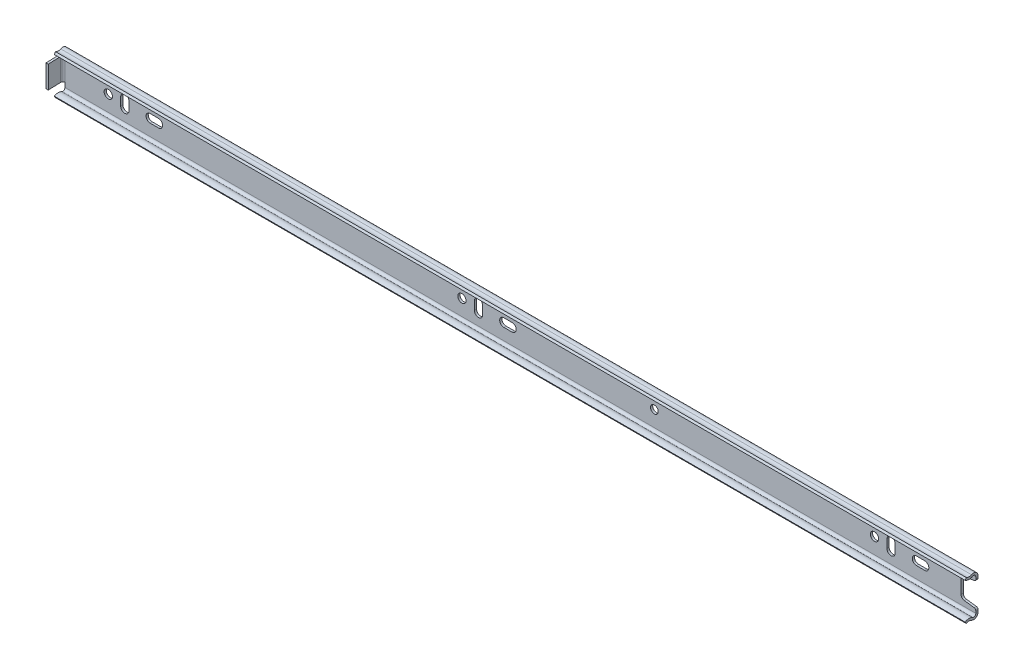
ISO-10303-21;
HEADER;
FILE_DESCRIPTION(('STEP AP214'),'2;1');
FILE_NAME('part.step','',(''),(''),'','','');
FILE_SCHEMA(('AUTOMOTIVE_DESIGN { 1 0 10303 214 1 1 1 1 }'));
ENDSEC;
DATA;
#1=APPLICATION_CONTEXT('core data for automotive mechanical design processes');
#2=APPLICATION_PROTOCOL_DEFINITION('international standard','automotive_design',2000,#1);
#3=PRODUCT_CONTEXT('',#1,'mechanical');
#4=PRODUCT('Part','Part','',(#3));
#5=PRODUCT_RELATED_PRODUCT_CATEGORY('part','',(#4));
#6=PRODUCT_DEFINITION_FORMATION('','',#4);
#7=PRODUCT_DEFINITION_CONTEXT('part definition',#1,'design');
#8=PRODUCT_DEFINITION('design','',#6,#7);
#9=PRODUCT_DEFINITION_SHAPE('','',#8);
#10=(LENGTH_UNIT() NAMED_UNIT(*) SI_UNIT(.MILLI.,.METRE.));
#11=(NAMED_UNIT(*) PLANE_ANGLE_UNIT() SI_UNIT($,.RADIAN.));
#12=(NAMED_UNIT(*) SI_UNIT($,.STERADIAN.) SOLID_ANGLE_UNIT());
#13=UNCERTAINTY_MEASURE_WITH_UNIT(LENGTH_MEASURE(1.E-05),#10,'distance_accuracy_value','');
#14=(GEOMETRIC_REPRESENTATION_CONTEXT(3) GLOBAL_UNCERTAINTY_ASSIGNED_CONTEXT((#13)) GLOBAL_UNIT_ASSIGNED_CONTEXT((#10,
#11,#12)) REPRESENTATION_CONTEXT('',''));
#15=CARTESIAN_POINT('',(0.,0.,0.));
#16=DIRECTION('',(0.,0.,1.));
#17=DIRECTION('',(1.,0.,0.));
#18=AXIS2_PLACEMENT_3D('',#15,#16,#17);
#19=CARTESIAN_POINT('',(248.5,-7.37697646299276,-1.2));
#20=DIRECTION('',(1.,0.,0.));
#21=DIRECTION('',(0.,1.,0.));
#22=AXIS2_PLACEMENT_3D('',#19,#20,#21);
#23=PLANE('',#22);
#24=DIRECTION('',(0.,1.,0.));
#25=VECTOR('',#24,1.);
#26=CARTESIAN_POINT('',(248.5,-7.37697646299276,-1.2));
#27=LINE('',#26,#25);
#28=CARTESIAN_POINT('',(248.5,-8.59999999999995,-1.2));
#29=VERTEX_POINT('',#28);
#30=CARTESIAN_POINT('',(248.5,-7.3769764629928,-1.2));
#31=VERTEX_POINT('',#30);
#32=EDGE_CURVE('E1394',#29,#31,#27,.T.);
#33=ORIENTED_EDGE('',*,*,#32,.T.);
#34=DIRECTION('',(0.,0.,-1.));
#35=VECTOR('',#34,1.);
#36=CARTESIAN_POINT('',(248.5,-7.3769764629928,0.));
#37=LINE('',#36,#35);
#38=CARTESIAN_POINT('',(248.5,-7.3769764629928,0.));
#39=VERTEX_POINT('',#38);
#40=EDGE_CURVE('E1999',#31,#39,#37,.F.);
#41=ORIENTED_EDGE('',*,*,#40,.T.);
#42=DIRECTION('',(0.,1.,0.));
#43=VECTOR('',#42,1.);
#44=CARTESIAN_POINT('',(248.5,7.37697646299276,0.));
#45=LINE('',#44,#43);
#46=CARTESIAN_POINT('',(248.5,-8.59999999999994,0.));
#47=VERTEX_POINT('',#46);
#48=EDGE_CURVE('E1520',#39,#47,#45,.F.);
#49=ORIENTED_EDGE('',*,*,#48,.T.);
#50=CARTESIAN_POINT('',(248.5,-8.59999999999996,1.2));
#51=DIRECTION('',(1.,0.,0.));
#52=DIRECTION('',(0.,1.,0.));
#53=AXIS2_PLACEMENT_3D('',#50,#51,#52);
#54=CIRCLE('',#53,1.2);
#55=CARTESIAN_POINT('',(248.5,-9.65844754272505,1.76541029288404));
#56=VERTEX_POINT('',#55);
#57=EDGE_CURVE('E1384',#47,#56,#54,.F.);
#58=ORIENTED_EDGE('',*,*,#57,.T.);
#59=CARTESIAN_POINT('',(248.5,-13.206442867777,3.66070788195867));
#60=DIRECTION('',(-1.,0.,0.));
#61=DIRECTION('',(0.,1.,0.));
#62=AXIS2_PLACEMENT_3D('',#59,#60,#61);
#63=CIRCLE('',#62,4.02248974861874);
#64=CARTESIAN_POINT('',(248.5,-9.1839531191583,3.66070788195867));
#65=VERTEX_POINT('',#64);
#66=EDGE_CURVE('E1429',#65,#56,#63,.T.);
#67=ORIENTED_EDGE('',*,*,#66,.F.);
#68=CARTESIAN_POINT('',(248.5,-13.206442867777,3.66070788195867));
#69=DIRECTION('',(-1.,0.,0.));
#70=DIRECTION('',(0.,0.846849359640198,0.531832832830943));
#71=AXIS2_PLACEMENT_3D('',#68,#69,#70);
#72=CIRCLE('',#71,4.02248974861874);
#73=CARTESIAN_POINT('',(248.5,-9.8,5.8));
#74=VERTEX_POINT('',#73);
#75=EDGE_CURVE('E1516',#74,#65,#72,.T.);
#76=ORIENTED_EDGE('',*,*,#75,.F.);
#77=DIRECTION('',(0.,-0.846849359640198,-0.531832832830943));
#78=VECTOR('',#77,1.);
#79=CARTESIAN_POINT('',(248.5,-9.8,5.8));
#80=LINE('',#79,#78);
#81=CARTESIAN_POINT('',(248.5,-10.8162192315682,5.16180060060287));
#82=VERTEX_POINT('',#81);
#83=EDGE_CURVE('E1690',#82,#74,#80,.F.);
#84=ORIENTED_EDGE('',*,*,#83,.F.);
#85=CARTESIAN_POINT('',(248.5,-10.8162192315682,5.16180060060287));
#86=CARTESIAN_POINT('',(248.5,-10.6042441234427,4.82426787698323));
#87=CARTESIAN_POINT('',(248.5,-10.4941716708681,4.44175419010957));
#88=CARTESIAN_POINT('',(248.5,-10.3839531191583,4.05873279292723));
#89=CARTESIAN_POINT('',(248.5,-10.3839531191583,3.66070788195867));
#90=B_SPLINE_CURVE_WITH_KNOTS('',2,(#85,#86,#87,#88,#89),.UNSPECIFIED.,.F.,.F.,(3,2,3),(0.,0.5,
1.),.UNSPECIFIED.);
#91=CARTESIAN_POINT('',(248.5,-10.3839531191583,3.66070788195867));
#92=VERTEX_POINT('',#91);
#93=EDGE_CURVE('E1846',#82,#92,#90,.T.);
#94=ORIENTED_EDGE('',*,*,#93,.T.);
#95=CARTESIAN_POINT('',(248.5,-13.206442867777,3.66070788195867));
#96=DIRECTION('',(1.,0.,0.));
#97=DIRECTION('',(0.,0.882039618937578,-0.47117524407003));
#98=AXIS2_PLACEMENT_3D('',#95,#96,#97);
#99=CIRCLE('',#98,2.82248974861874);
#100=CARTESIAN_POINT('',(248.5,-10.7168950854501,2.33082058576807));
#101=VERTEX_POINT('',#100);
#102=EDGE_CURVE('E2722',#101,#92,#99,.T.);
#103=ORIENTED_EDGE('',*,*,#102,.F.);
#104=CARTESIAN_POINT('',(248.5,-10.7168950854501,2.33082058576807));
#105=CARTESIAN_POINT('',(248.5,-10.8607798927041,2.06146836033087));
#106=CARTESIAN_POINT('',(248.5,-10.9327460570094,1.76417712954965));
#107=CARTESIAN_POINT('',(248.5,-11.0070315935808,1.45730460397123));
#108=CARTESIAN_POINT('',(248.5,-10.9992660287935,1.1406491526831));
#109=CARTESIAN_POINT('',(248.5,-10.9915253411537,0.825008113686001));
#110=CARTESIAN_POINT('',(248.5,-10.9019977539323,0.521172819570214));
#111=CARTESIAN_POINT('',(248.5,-10.8157582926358,0.228496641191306));
#112=CARTESIAN_POINT('',(248.5,-10.6583937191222,-0.0341050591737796));
#113=CARTESIAN_POINT('',(248.5,-10.5015559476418,-0.29582766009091));
#114=CARTESIAN_POINT('',(248.5,-10.2833968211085,-0.51060665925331));
#115=CARTESIAN_POINT('',(248.5,-10.0584016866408,-0.732115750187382));
#116=CARTESIAN_POINT('',(248.5,-9.78282455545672,-0.888283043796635));
#117=CARTESIAN_POINT('',(248.5,-9.50813024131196,-1.04395005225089));
#118=CARTESIAN_POINT('',(248.5,-9.20150561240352,-1.12340073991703));
#119=CARTESIAN_POINT('',(248.5,-8.90588551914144,-1.2));
#120=CARTESIAN_POINT('',(248.5,-8.59999999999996,-1.2));
#121=B_SPLINE_CURVE_WITH_KNOTS('',2,(#104,#105,#106,#107,#108,#109,#110,#111,#112,#113,#114,
#115,#116,#117,#118,#119,#120),.UNSPECIFIED.,.F.,.F.,(3,2,2,2,2,2,2,2,3),(0.,0.125,0.25,0.375,
0.5,0.625,0.75,0.875,1.),.UNSPECIFIED.);
#122=EDGE_CURVE('E1442',#101,#29,#121,.T.);
#123=ORIENTED_EDGE('',*,*,#122,.T.);
#124=EDGE_LOOP('',(#33,#41,#49,#58,#67,#76,#84,#94,#103,#123));
#125=FACE_BOUND('',#124,.T.);
#126=ADVANCED_FACE('F49',(#125),#23,.T.);
#127=CARTESIAN_POINT('',(1.25,-9.8,5.8));
#128=DIRECTION('',(0.,-0.531832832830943,0.846849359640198));
#129=DIRECTION('',(0.,-0.846849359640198,-0.531832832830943));
#130=AXIS2_PLACEMENT_3D('',#127,#128,#129);
#131=PLANE('',#130);
#132=DIRECTION('',(1.,0.,0.));
#133=VECTOR('',#132,1.);
#134=CARTESIAN_POINT('',(-246.,-9.8,5.8));
#135=LINE('',#134,#133);
#136=CARTESIAN_POINT('',(-246.,-9.8,5.8));
#137=VERTEX_POINT('',#136);
#138=EDGE_CURVE('E1757',#137,#74,#135,.T.);
#139=ORIENTED_EDGE('',*,*,#138,.F.);
#140=DIRECTION('',(0.,0.846849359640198,0.531832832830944));
#141=VECTOR('',#140,1.);
#142=CARTESIAN_POINT('',(-246.,-10.8162192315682,5.16180060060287));
#143=LINE('',#142,#141);
#144=CARTESIAN_POINT('',(-246.000313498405,-10.8162192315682,5.16180060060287));
#145=VERTEX_POINT('',#144);
#146=EDGE_CURVE('E1921',#145,#137,#143,.T.);
#147=ORIENTED_EDGE('',*,*,#146,.F.);
#148=DIRECTION('',(1.,0.,0.));
#149=VECTOR('',#148,1.);
#150=CARTESIAN_POINT('',(1.25,-10.8162192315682,5.16180060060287));
#151=LINE('',#150,#149);
#152=EDGE_CURVE('E1809',#145,#82,#151,.T.);
#153=ORIENTED_EDGE('',*,*,#152,.T.);
#154=ORIENTED_EDGE('',*,*,#83,.T.);
#155=EDGE_LOOP('',(#139,#147,#153,#154));
#156=FACE_BOUND('',#155,.T.);
#157=ADVANCED_FACE('F866',(#156),#131,.T.);
#158=CARTESIAN_POINT('',(247.5,7.37697646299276,-1.2));
#159=DIRECTION('',(0.,0.,-1.));
#160=DIRECTION('',(-1.,0.,0.));
#161=AXIS2_PLACEMENT_3D('',#158,#159,#160);
#162=PLANE('',#161);
#163=CARTESIAN_POINT('',(193.5,0.,-1.2));
#164=DIRECTION('',(0.,0.,-1.));
#165=DIRECTION('',(-1.,0.,0.));
#166=AXIS2_PLACEMENT_3D('',#163,#164,#165);
#167=CIRCLE('',#166,2.24999999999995);
#168=CARTESIAN_POINT('',(191.25,0.,-1.2));
#169=VERTEX_POINT('',#168);
#170=EDGE_CURVE('E3093',#169,#169,#167,.T.);
#171=ORIENTED_EDGE('',*,*,#170,.F.);
#172=EDGE_LOOP('',(#171));
#173=FACE_BOUND('',#172,.T.);
#174=CARTESIAN_POINT('',(-30.5,0.,-1.2));
#175=DIRECTION('',(0.,0.,-1.));
#176=DIRECTION('',(-1.,0.,0.));
#177=AXIS2_PLACEMENT_3D('',#174,#175,#176);
#178=CIRCLE('',#177,2.24999999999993);
#179=CARTESIAN_POINT('',(-32.7499999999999,0.,-1.2));
#180=VERTEX_POINT('',#179);
#181=EDGE_CURVE('E3087',#180,#180,#178,.T.);
#182=ORIENTED_EDGE('',*,*,#181,.F.);
#183=EDGE_LOOP('',(#182));
#184=FACE_BOUND('',#183,.T.);
#185=CARTESIAN_POINT('',(-222.5,0.,-1.2));
#186=DIRECTION('',(0.,0.,-1.));
#187=DIRECTION('',(-1.,0.,0.));
#188=AXIS2_PLACEMENT_3D('',#185,#186,#187);
#189=CIRCLE('',#188,2.24999999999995);
#190=CARTESIAN_POINT('',(-224.75,0.,-1.2));
#191=VERTEX_POINT('',#190);
#192=EDGE_CURVE('E3081',#191,#191,#189,.T.);
#193=ORIENTED_EDGE('',*,*,#192,.F.);
#194=EDGE_LOOP('',(#193));
#195=FACE_BOUND('',#194,.T.);
#196=CARTESIAN_POINT('',(74.,0.,-1.2));
#197=DIRECTION('',(0.,0.,-1.));
#198=DIRECTION('',(-1.,0.,0.));
#199=AXIS2_PLACEMENT_3D('',#196,#197,#198);
#200=CIRCLE('',#199,2.09999999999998);
#201=CARTESIAN_POINT('',(71.9,0.,-1.2));
#202=VERTEX_POINT('',#201);
#203=EDGE_CURVE('E3073',#202,#202,#200,.T.);
#204=ORIENTED_EDGE('',*,*,#203,.F.);
#205=EDGE_LOOP('',(#204));
#206=FACE_BOUND('',#205,.T.);
#207=CARTESIAN_POINT('',(220.75,0.,-1.2));
#208=DIRECTION('',(0.,0.,-1.));
#209=DIRECTION('',(-1.,0.,0.));
#210=AXIS2_PLACEMENT_3D('',#207,#208,#209);
#211=CIRCLE('',#210,2.25);
#212=CARTESIAN_POINT('',(220.75,2.25000000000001,-1.2));
#213=VERTEX_POINT('',#212);
#214=CARTESIAN_POINT('',(220.75,-2.25,-1.2));
#215=VERTEX_POINT('',#214);
#216=EDGE_CURVE('E459',#213,#215,#211,.T.);
#217=ORIENTED_EDGE('',*,*,#216,.F.);
#218=DIRECTION('',(1.,0.,0.));
#219=VECTOR('',#218,1.);
#220=CARTESIAN_POINT('',(247.5,2.25000000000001,-1.2));
#221=LINE('',#220,#219);
#222=CARTESIAN_POINT('',(216.25,2.25000000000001,-1.2));
#223=VERTEX_POINT('',#222);
#224=EDGE_CURVE('E452',#223,#213,#221,.T.);
#225=ORIENTED_EDGE('',*,*,#224,.F.);
#226=CARTESIAN_POINT('',(216.25,0.,-1.2));
#227=DIRECTION('',(0.,0.,-1.));
#228=DIRECTION('',(-1.,0.,0.));
#229=AXIS2_PLACEMENT_3D('',#226,#227,#228);
#230=CIRCLE('',#229,2.25);
#231=CARTESIAN_POINT('',(216.25,-2.25,-1.2));
#232=VERTEX_POINT('',#231);
#233=EDGE_CURVE('E427',#232,#223,#230,.T.);
#234=ORIENTED_EDGE('',*,*,#233,.F.);
#235=DIRECTION('',(-1.,0.,0.));
#236=VECTOR('',#235,1.);
#237=CARTESIAN_POINT('',(247.5,-2.25000000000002,-1.2));
#238=LINE('',#237,#236);
#239=EDGE_CURVE('E457',#215,#232,#238,.T.);
#240=ORIENTED_EDGE('',*,*,#239,.F.);
#241=EDGE_LOOP('',(#217,#225,#234,#240));
#242=FACE_BOUND('',#241,.T.);
#243=CARTESIAN_POINT('',(202.5,-2.25,-1.2));
#244=DIRECTION('',(0.,0.,-1.));
#245=DIRECTION('',(-1.,0.,0.));
#246=AXIS2_PLACEMENT_3D('',#243,#244,#245);
#247=CIRCLE('',#246,2.25000000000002);
#248=CARTESIAN_POINT('',(204.75,-2.25,-1.2));
#249=VERTEX_POINT('',#248);
#250=CARTESIAN_POINT('',(200.25,-2.25,-1.2));
#251=VERTEX_POINT('',#250);
#252=EDGE_CURVE('E461',#249,#251,#247,.T.);
#253=ORIENTED_EDGE('',*,*,#252,.F.);
#254=DIRECTION('',(0.,-1.,0.));
#255=VECTOR('',#254,1.);
#256=CARTESIAN_POINT('',(204.75,2.25,-1.2));
#257=LINE('',#256,#255);
#258=CARTESIAN_POINT('',(204.75,2.25,-1.2));
#259=VERTEX_POINT('',#258);
#260=EDGE_CURVE('E469',#259,#249,#257,.T.);
#261=ORIENTED_EDGE('',*,*,#260,.F.);
#262=CARTESIAN_POINT('',(202.5,2.25,-1.2));
#263=DIRECTION('',(0.,0.,-1.));
#264=DIRECTION('',(-1.,0.,0.));
#265=AXIS2_PLACEMENT_3D('',#262,#263,#264);
#266=CIRCLE('',#265,2.25);
#267=CARTESIAN_POINT('',(200.25,2.25,-1.2));
#268=VERTEX_POINT('',#267);
#269=EDGE_CURVE('E466',#268,#259,#266,.T.);
#270=ORIENTED_EDGE('',*,*,#269,.F.);
#271=DIRECTION('',(0.,1.,0.));
#272=VECTOR('',#271,1.);
#273=CARTESIAN_POINT('',(200.25,-2.25,-1.2));
#274=LINE('',#273,#272);
#275=EDGE_CURVE('E463',#251,#268,#274,.T.);
#276=ORIENTED_EDGE('',*,*,#275,.F.);
#277=EDGE_LOOP('',(#253,#261,#270,#276));
#278=FACE_BOUND('',#277,.T.);
#279=CARTESIAN_POINT('',(-7.75000000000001,0.,-1.2));
#280=DIRECTION('',(0.,0.,-1.));
#281=DIRECTION('',(-1.,0.,0.));
#282=AXIS2_PLACEMENT_3D('',#279,#280,#281);
#283=CIRCLE('',#282,2.25);
#284=CARTESIAN_POINT('',(-7.75000000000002,-2.25,-1.2));
#285=VERTEX_POINT('',#284);
#286=CARTESIAN_POINT('',(-7.75000000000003,2.25000000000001,-1.2));
#287=VERTEX_POINT('',#286);
#288=EDGE_CURVE('E475',#285,#287,#283,.T.);
#289=ORIENTED_EDGE('',*,*,#288,.F.);
#290=DIRECTION('',(-1.,0.,0.));
#291=VECTOR('',#290,1.);
#292=CARTESIAN_POINT('',(-3.24999999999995,-2.25,-1.2));
#293=LINE('',#292,#291);
#294=CARTESIAN_POINT('',(-3.24999999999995,-2.25,-1.2));
#295=VERTEX_POINT('',#294);
#296=EDGE_CURVE('E489',#295,#285,#293,.T.);
#297=ORIENTED_EDGE('',*,*,#296,.F.);
#298=CARTESIAN_POINT('',(-3.24999999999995,0.,-1.2));
#299=DIRECTION('',(0.,0.,-1.));
#300=DIRECTION('',(-1.,0.,0.));
#301=AXIS2_PLACEMENT_3D('',#298,#299,#300);
#302=CIRCLE('',#301,2.25);
#303=CARTESIAN_POINT('',(-3.24999999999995,2.25000000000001,-1.2));
#304=VERTEX_POINT('',#303);
#305=EDGE_CURVE('E486',#304,#295,#302,.T.);
#306=ORIENTED_EDGE('',*,*,#305,.F.);
#307=DIRECTION('',(1.,0.,0.));
#308=VECTOR('',#307,1.);
#309=CARTESIAN_POINT('',(-7.75000000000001,2.25000000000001,-1.2));
#310=LINE('',#309,#308);
#311=EDGE_CURVE('E483',#287,#304,#310,.T.);
#312=ORIENTED_EDGE('',*,*,#311,.F.);
#313=EDGE_LOOP('',(#289,#297,#306,#312));
#314=FACE_BOUND('',#313,.T.);
#315=CARTESIAN_POINT('',(-21.5,-2.25,-1.2));
#316=DIRECTION('',(0.,0.,-1.));
#317=DIRECTION('',(-1.,0.,0.));
#318=AXIS2_PLACEMENT_3D('',#315,#316,#317);
#319=CIRCLE('',#318,2.25);
#320=CARTESIAN_POINT('',(-19.25,-2.25,-1.2));
#321=VERTEX_POINT('',#320);
#322=CARTESIAN_POINT('',(-23.75,-2.25,-1.2));
#323=VERTEX_POINT('',#322);
#324=EDGE_CURVE('E495',#321,#323,#319,.T.);
#325=ORIENTED_EDGE('',*,*,#324,.F.);
#326=DIRECTION('',(0.,-1.,0.));
#327=VECTOR('',#326,1.);
#328=CARTESIAN_POINT('',(-19.25,2.25,-1.2));
#329=LINE('',#328,#327);
#330=CARTESIAN_POINT('',(-19.25,2.25,-1.2));
#331=VERTEX_POINT('',#330);
#332=EDGE_CURVE('E509',#331,#321,#329,.T.);
#333=ORIENTED_EDGE('',*,*,#332,.F.);
#334=CARTESIAN_POINT('',(-21.5,2.25,-1.2));
#335=DIRECTION('',(0.,0.,-1.));
#336=DIRECTION('',(-1.,0.,0.));
#337=AXIS2_PLACEMENT_3D('',#334,#335,#336);
#338=CIRCLE('',#337,2.25);
#339=CARTESIAN_POINT('',(-23.75,2.25,-1.2));
#340=VERTEX_POINT('',#339);
#341=EDGE_CURVE('E506',#340,#331,#338,.T.);
#342=ORIENTED_EDGE('',*,*,#341,.F.);
#343=DIRECTION('',(0.,1.,0.));
#344=VECTOR('',#343,1.);
#345=CARTESIAN_POINT('',(-23.75,-2.25,-1.2));
#346=LINE('',#345,#344);
#347=EDGE_CURVE('E503',#323,#340,#346,.T.);
#348=ORIENTED_EDGE('',*,*,#347,.F.);
#349=EDGE_LOOP('',(#325,#333,#342,#348));
#350=FACE_BOUND('',#349,.T.);
#351=CARTESIAN_POINT('',(-199.75,0.,-1.2));
#352=DIRECTION('',(0.,0.,-1.));
#353=DIRECTION('',(-1.,0.,0.));
#354=AXIS2_PLACEMENT_3D('',#351,#352,#353);
#355=CIRCLE('',#354,2.25);
#356=CARTESIAN_POINT('',(-199.75,-2.25,-1.2));
#357=VERTEX_POINT('',#356);
#358=CARTESIAN_POINT('',(-199.75,2.25000000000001,-1.2));
#359=VERTEX_POINT('',#358);
#360=EDGE_CURVE('E515',#357,#359,#355,.T.);
#361=ORIENTED_EDGE('',*,*,#360,.F.);
#362=DIRECTION('',(-1.,0.,0.));
#363=VECTOR('',#362,1.);
#364=CARTESIAN_POINT('',(-195.25,-2.25,-1.2));
#365=LINE('',#364,#363);
#366=CARTESIAN_POINT('',(-195.25,-2.25,-1.2));
#367=VERTEX_POINT('',#366);
#368=EDGE_CURVE('E529',#367,#357,#365,.T.);
#369=ORIENTED_EDGE('',*,*,#368,.F.);
#370=CARTESIAN_POINT('',(-195.25,0.,-1.2));
#371=DIRECTION('',(0.,0.,-1.));
#372=DIRECTION('',(-1.,0.,0.));
#373=AXIS2_PLACEMENT_3D('',#370,#371,#372);
#374=CIRCLE('',#373,2.25);
#375=CARTESIAN_POINT('',(-195.25,2.25000000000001,-1.2));
#376=VERTEX_POINT('',#375);
#377=EDGE_CURVE('E526',#376,#367,#374,.T.);
#378=ORIENTED_EDGE('',*,*,#377,.F.);
#379=DIRECTION('',(1.,0.,0.));
#380=VECTOR('',#379,1.);
#381=CARTESIAN_POINT('',(-199.75,2.25000000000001,-1.2));
#382=LINE('',#381,#380);
#383=EDGE_CURVE('E523',#359,#376,#382,.T.);
#384=ORIENTED_EDGE('',*,*,#383,.F.);
#385=EDGE_LOOP('',(#361,#369,#378,#384));
#386=FACE_BOUND('',#385,.T.);
#387=CARTESIAN_POINT('',(-213.5,-2.25,-1.2));
#388=DIRECTION('',(0.,0.,-1.));
#389=DIRECTION('',(-1.,0.,0.));
#390=AXIS2_PLACEMENT_3D('',#387,#388,#389);
#391=CIRCLE('',#390,2.25);
#392=CARTESIAN_POINT('',(-211.25,-2.25,-1.2));
#393=VERTEX_POINT('',#392);
#394=CARTESIAN_POINT('',(-215.75,-2.25,-1.2));
#395=VERTEX_POINT('',#394);
#396=EDGE_CURVE('E535',#393,#395,#391,.T.);
#397=ORIENTED_EDGE('',*,*,#396,.F.);
#398=DIRECTION('',(0.,-1.,0.));
#399=VECTOR('',#398,1.);
#400=CARTESIAN_POINT('',(-211.25,2.25,-1.2));
#401=LINE('',#400,#399);
#402=CARTESIAN_POINT('',(-211.25,2.25,-1.2));
#403=VERTEX_POINT('',#402);
#404=EDGE_CURVE('E549',#403,#393,#401,.T.);
#405=ORIENTED_EDGE('',*,*,#404,.F.);
#406=CARTESIAN_POINT('',(-213.5,2.25,-1.2));
#407=DIRECTION('',(0.,0.,-1.));
#408=DIRECTION('',(-1.,0.,0.));
#409=AXIS2_PLACEMENT_3D('',#406,#407,#408);
#410=CIRCLE('',#409,2.25);
#411=CARTESIAN_POINT('',(-215.75,2.25,-1.2));
#412=VERTEX_POINT('',#411);
#413=EDGE_CURVE('E546',#412,#403,#410,.T.);
#414=ORIENTED_EDGE('',*,*,#413,.F.);
#415=DIRECTION('',(0.,1.,0.));
#416=VECTOR('',#415,1.);
#417=CARTESIAN_POINT('',(-215.75,-2.25,-1.2));
#418=LINE('',#417,#416);
#419=EDGE_CURVE('E543',#395,#412,#418,.T.);
#420=ORIENTED_EDGE('',*,*,#419,.F.);
#421=EDGE_LOOP('',(#397,#405,#414,#420));
#422=FACE_BOUND('',#421,.T.);
#423=DIRECTION('',(0.99144486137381,-0.130526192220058,0.));
#424=VECTOR('',#423,1.);
#425=CARTESIAN_POINT('',(245.721224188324,-6.13416722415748,-1.2));
#426=LINE('',#425,#424);
#427=CARTESIAN_POINT('',(247.63052619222,-6.38553160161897,-1.2));
#428=VERTEX_POINT('',#427);
#429=CARTESIAN_POINT('',(242.23894761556,-5.67571681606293,-1.2));
#430=VERTEX_POINT('',#429);
#431=EDGE_CURVE('E569',#428,#430,#426,.F.);
#432=ORIENTED_EDGE('',*,*,#431,.F.);
#433=CARTESIAN_POINT('',(247.5,-7.37697646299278,-1.2));
#434=DIRECTION('',(0.,0.,-1.));
#435=DIRECTION('',(-1.,0.,0.));
#436=AXIS2_PLACEMENT_3D('',#433,#434,#435);
#437=CIRCLE('',#436,1.);
#438=EDGE_CURVE('E2011',#428,#31,#437,.T.);
#439=ORIENTED_EDGE('',*,*,#438,.T.);
#440=ORIENTED_EDGE('',*,*,#32,.F.);
#441=DIRECTION('',(-1.,0.,0.));
#442=VECTOR('',#441,1.);
#443=CARTESIAN_POINT('',(247.5,-8.59999999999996,-1.2));
#444=LINE('',#443,#442);
#445=CARTESIAN_POINT('',(-246.000345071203,-8.59999999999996,-1.2));
#446=VERTEX_POINT('',#445);
#447=EDGE_CURVE('E972',#29,#446,#444,.T.);
#448=ORIENTED_EDGE('',*,*,#447,.T.);
#449=DIRECTION('',(0.,-1.,0.));
#450=VECTOR('',#449,1.);
#451=CARTESIAN_POINT('',(-246.,-6.09999999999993,-1.2));
#452=LINE('',#451,#450);
#453=CARTESIAN_POINT('',(-246.,-6.09999999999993,-1.19785700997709));
#454=VERTEX_POINT('',#453);
#455=EDGE_CURVE('E580',#454,#446,#452,.T.);
#456=ORIENTED_EDGE('',*,*,#455,.F.);
#457=CARTESIAN_POINT('',(-246.,-6.09999999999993,-1.2));
#458=DIRECTION('',(1.,0.,0.));
#459=VECTOR('',#458,1.);
#460=LINE('',#457,#459);
#461=CARTESIAN_POINT('',(-245.856632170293,-6.09999999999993,-1.2));
#462=VERTEX_POINT('',#461);
#463=EDGE_CURVE('E1423',#454,#462,#460,.T.);
#464=ORIENTED_EDGE('',*,*,#463,.T.);
#465=DIRECTION('',(0.,1.,0.));
#466=VECTOR('',#465,1.);
#467=CARTESIAN_POINT('',(-245.856632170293,7.37697646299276,-1.2));
#468=LINE('',#467,#466);
#469=CARTESIAN_POINT('',(-245.856632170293,6.10000000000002,-1.2));
#470=VERTEX_POINT('',#469);
#471=EDGE_CURVE('E1126',#462,#470,#468,.T.);
#472=ORIENTED_EDGE('',*,*,#471,.T.);
#473=CARTESIAN_POINT('',(-245.856632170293,6.10000000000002,1.20000000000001));
#474=DIRECTION('',(0.,-1.,0.));
#475=DIRECTION('',(-0.0597365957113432,0.,-0.99821417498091));
#476=AXIS2_PLACEMENT_3D('',#473,#474,#475);
#477=CIRCLE('',#476,2.40000000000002);
#478=CARTESIAN_POINT('',(-246.,6.10000000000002,-1.1978570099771));
#479=VERTEX_POINT('',#478);
#480=EDGE_CURVE('E1465',#479,#470,#477,.T.);
#481=ORIENTED_EDGE('',*,*,#480,.F.);
#482=DIRECTION('',(0.,-1.,0.));
#483=VECTOR('',#482,1.);
#484=CARTESIAN_POINT('',(-246.,7.37697646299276,-1.2));
#485=LINE('',#484,#483);
#486=CARTESIAN_POINT('',(-246.,8.59999999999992,-1.2));
#487=VERTEX_POINT('',#486);
#488=EDGE_CURVE('E2783',#487,#479,#485,.T.);
#489=ORIENTED_EDGE('',*,*,#488,.F.);
#490=DIRECTION('',(-1.,0.,0.));
#491=VECTOR('',#490,1.);
#492=CARTESIAN_POINT('',(247.5,8.59999999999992,-1.2));
#493=LINE('',#492,#491);
#494=CARTESIAN_POINT('',(248.5,8.59999999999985,-1.2));
#495=VERTEX_POINT('',#494);
#496=EDGE_CURVE('E974',#487,#495,#493,.F.);
#497=ORIENTED_EDGE('',*,*,#496,.T.);
#498=CARTESIAN_POINT('',(248.5,7.3769764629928,-1.2));
#499=VERTEX_POINT('',#498);
#500=EDGE_CURVE('E1398',#499,#495,#27,.T.);
#501=ORIENTED_EDGE('',*,*,#500,.F.);
#502=CARTESIAN_POINT('',(247.5,7.37697646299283,-1.2));
#503=DIRECTION('',(0.,0.,-1.));
#504=DIRECTION('',(-1.,0.,0.));
#505=AXIS2_PLACEMENT_3D('',#502,#503,#504);
#506=CIRCLE('',#505,1.);
#507=CARTESIAN_POINT('',(247.63052619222,6.38553160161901,-1.2));
#508=VERTEX_POINT('',#507);
#509=EDGE_CURVE('E2007',#499,#508,#506,.T.);
#510=ORIENTED_EDGE('',*,*,#509,.T.);
#511=DIRECTION('',(-0.99144486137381,-0.130526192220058,0.));
#512=VECTOR('',#511,1.);
#513=CARTESIAN_POINT('',(247.63052619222,6.38553160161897,-1.2));
#514=LINE('',#513,#512);
#515=CARTESIAN_POINT('',(242.23894761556,5.67571681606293,-1.2));
#516=VERTEX_POINT('',#515);
#517=EDGE_CURVE('E570',#516,#508,#514,.F.);
#518=ORIENTED_EDGE('',*,*,#517,.F.);
#519=CARTESIAN_POINT('',(242.5,3.69282709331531,-1.2));
#520=DIRECTION('',(0.,0.,-1.));
#521=DIRECTION('',(-1.,0.,0.));
#522=AXIS2_PLACEMENT_3D('',#519,#520,#521);
#523=CIRCLE('',#522,2.);
#524=CARTESIAN_POINT('',(240.5,3.69282709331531,-1.2));
#525=VERTEX_POINT('',#524);
#526=EDGE_CURVE('E13',#516,#525,#523,.F.);
#527=ORIENTED_EDGE('',*,*,#526,.T.);
#528=DIRECTION('',(0.,1.,0.));
#529=VECTOR('',#528,1.);
#530=CARTESIAN_POINT('',(240.5,7.37697646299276,-1.2));
#531=LINE('',#530,#529);
#532=CARTESIAN_POINT('',(240.5,-3.69282709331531,-1.2));
#533=VERTEX_POINT('',#532);
#534=EDGE_CURVE('E566',#533,#525,#531,.T.);
#535=ORIENTED_EDGE('',*,*,#534,.F.);
#536=CARTESIAN_POINT('',(242.5,-3.69282709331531,-1.2));
#537=DIRECTION('',(0.,0.,-1.));
#538=DIRECTION('',(-1.,0.,0.));
#539=AXIS2_PLACEMENT_3D('',#536,#537,#538);
#540=CIRCLE('',#539,2.);
#541=EDGE_CURVE('E2047',#533,#430,#540,.F.);
#542=ORIENTED_EDGE('',*,*,#541,.T.);
#543=EDGE_LOOP('',(#432,#439,#440,#448,#456,#464,#472,#481,#489,#497,#501,#510,#518,#527,#535,#542));
#544=FACE_BOUND('',#543,.T.);
#545=ADVANCED_FACE('F876',(#173,#184,#195,#206,#242,#278,#314,#350,#386,#422,#544),#162,.T.);
#546=CARTESIAN_POINT('',(-246.,-8.59999999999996,1.2));
#547=DIRECTION('',(1.,0.,0.));
#548=DIRECTION('',(0.,1.,0.));
#549=AXIS2_PLACEMENT_3D('',#546,#547,#548);
#550=CYLINDRICAL_SURFACE('',#549,1.2);
#551=CARTESIAN_POINT('',(-246.,-8.59999999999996,1.2));
#552=DIRECTION('',(1.,0.,0.));
#553=DIRECTION('',(0.,0.,-1.));
#554=AXIS2_PLACEMENT_3D('',#551,#552,#553);
#555=CIRCLE('',#554,1.2);
#556=CARTESIAN_POINT('',(-246.,-9.65844754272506,1.76541029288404));
#557=VERTEX_POINT('',#556);
#558=CARTESIAN_POINT('',(-246.,-8.45663217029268,0.00859508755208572));
#559=VERTEX_POINT('',#558);
#560=EDGE_CURVE('E2774',#557,#559,#555,.T.);
#561=ORIENTED_EDGE('',*,*,#560,.F.);
#562=DIRECTION('',(1.,0.,0.));
#563=VECTOR('',#562,1.);
#564=CARTESIAN_POINT('',(-246.,-9.65844754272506,1.76541029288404));
#565=LINE('',#564,#563);
#566=EDGE_CURVE('E1393',#56,#557,#565,.F.);
#567=ORIENTED_EDGE('',*,*,#566,.F.);
#568=ORIENTED_EDGE('',*,*,#57,.F.);
#569=DIRECTION('',(-1.,0.,0.));
#570=VECTOR('',#569,1.);
#571=CARTESIAN_POINT('',(247.5,-8.59999999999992,0.));
#572=LINE('',#571,#570);
#573=CARTESIAN_POINT('',(-245.856632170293,-8.59999999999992,0.));
#574=VERTEX_POINT('',#573);
#575=EDGE_CURVE('E1526',#47,#574,#572,.T.);
#576=ORIENTED_EDGE('',*,*,#575,.T.);
#577=CARTESIAN_POINT('',(-245.856632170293,-8.59999999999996,1.2));
#578=DIRECTION('',(0.707106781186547,0.707106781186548,0.));
#579=DIRECTION('',(0.707106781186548,-0.707106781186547,0.));
#580=AXIS2_PLACEMENT_3D('',#577,#578,#579);
#581=ELLIPSE('',#580,1.69705627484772,1.2);
#582=EDGE_CURVE('E2021',#574,#559,#581,.T.);
#583=ORIENTED_EDGE('',*,*,#582,.T.);
#584=EDGE_LOOP('',(#561,#567,#568,#576,#583));
#585=FACE_BOUND('',#584,.T.);
#586=ADVANCED_FACE('F1019',(#585),#550,.F.);
#587=CARTESIAN_POINT('',(-246.,13.2064428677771,3.6607078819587));
#588=DIRECTION('',(1.,0.,0.));
#589=DIRECTION('',(0.,1.,0.));
#590=AXIS2_PLACEMENT_3D('',#587,#588,#589);
#591=CYLINDRICAL_SURFACE('',#590,2.82248974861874);
#592=CARTESIAN_POINT('',(248.5,10.7168950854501,2.33082058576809));
#593=CARTESIAN_POINT('',(248.5,10.5443481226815,2.65382833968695));
#594=CARTESIAN_POINT('',(248.5,10.4598287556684,3.01066226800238));
#595=CARTESIAN_POINT('',(248.5,10.3724252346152,3.37967286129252));
#596=CARTESIAN_POINT('',(248.5,10.3856886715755,3.75967325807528));
#597=CARTESIAN_POINT('',(248.5,10.3989168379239,4.13866314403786));
#598=CARTESIAN_POINT('',(248.5,10.5121395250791,4.50164657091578));
#599=CARTESIAN_POINT('',(248.5,10.6211881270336,4.8512481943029));
#600=CARTESIAN_POINT('',(248.5,10.8162192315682,5.16180060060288));
#601=B_SPLINE_CURVE_WITH_KNOTS('',2,(#592,#593,#594,#595,#596,#597,#598,#599,#600),
.UNSPECIFIED.,.F.,.F.,(3,2,2,2,3),(0.,0.25,0.5,0.75,1.),.UNSPECIFIED.);
#602=CARTESIAN_POINT('',(248.5,10.7168950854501,2.33082058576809));
#603=VERTEX_POINT('',#602);
#604=CARTESIAN_POINT('',(248.5,10.8162192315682,5.16180060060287));
#605=VERTEX_POINT('',#604);
#606=EDGE_CURVE('E1368',#603,#605,#601,.T.);
#607=ORIENTED_EDGE('',*,*,#606,.F.);
#608=DIRECTION('',(1.,0.,0.));
#609=VECTOR('',#608,1.);
#610=CARTESIAN_POINT('',(-246.,10.7168950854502,2.33082058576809));
#611=LINE('',#610,#609);
#612=CARTESIAN_POINT('',(-246.,10.7168950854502,2.33082058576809));
#613=VERTEX_POINT('',#612);
#614=EDGE_CURVE('E1350',#613,#603,#611,.T.);
#615=ORIENTED_EDGE('',*,*,#614,.F.);
#616=CARTESIAN_POINT('',(-246.,13.2064428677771,3.6607078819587));
#617=DIRECTION('',(-1.,0.,0.));
#618=DIRECTION('',(0.,-0.882039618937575,-0.471175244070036));
#619=AXIS2_PLACEMENT_3D('',#616,#617,#618);
#620=CIRCLE('',#619,2.82248974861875);
#621=CARTESIAN_POINT('',(-246.000313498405,10.8162192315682,5.16180060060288));
#622=VERTEX_POINT('',#621);
#623=EDGE_CURVE('E1379',#613,#622,#620,.T.);
#624=ORIENTED_EDGE('',*,*,#623,.T.);
#625=DIRECTION('',(1.,0.,0.));
#626=VECTOR('',#625,1.);
#627=CARTESIAN_POINT('',(1.25,10.8162192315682,5.16180060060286));
#628=LINE('',#627,#626);
#629=EDGE_CURVE('E1352',#622,#605,#628,.T.);
#630=ORIENTED_EDGE('',*,*,#629,.T.);
#631=EDGE_LOOP('',(#607,#615,#624,#630));
#632=FACE_BOUND('',#631,.T.);
#633=ADVANCED_FACE('F884',(#632),#591,.F.);
#634=CARTESIAN_POINT('',(1.25,9.79999999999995,5.8));
#635=DIRECTION('',(0.,-0.531832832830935,-0.846849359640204));
#636=DIRECTION('',(0.,0.846849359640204,-0.531832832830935));
#637=AXIS2_PLACEMENT_3D('',#634,#635,#636);
#638=PLANE('',#637);
#639=ORIENTED_EDGE('',*,*,#629,.F.);
#640=DIRECTION('',(0.,-0.846849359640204,0.531832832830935));
#641=VECTOR('',#640,1.);
#642=CARTESIAN_POINT('',(-246.,9.79999999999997,5.80000000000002));
#643=LINE('',#642,#641);
#644=CARTESIAN_POINT('',(-246.,9.8,5.8));
#645=VERTEX_POINT('',#644);
#646=EDGE_CURVE('E2792',#622,#645,#643,.T.);
#647=ORIENTED_EDGE('',*,*,#646,.T.);
#648=DIRECTION('',(1.,0.,0.));
#649=VECTOR('',#648,1.);
#650=CARTESIAN_POINT('',(-246.,9.8,5.8));
#651=LINE('',#650,#649);
#652=CARTESIAN_POINT('',(248.5,9.79999999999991,5.8));
#653=VERTEX_POINT('',#652);
#654=EDGE_CURVE('E1647',#653,#645,#651,.F.);
#655=ORIENTED_EDGE('',*,*,#654,.F.);
#656=DIRECTION('',(0.,-0.846849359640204,0.531832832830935));
#657=VECTOR('',#656,1.);
#658=CARTESIAN_POINT('',(248.5,10.8162192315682,5.16180060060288));
#659=LINE('',#658,#657);
#660=EDGE_CURVE('E1661',#605,#653,#659,.T.);
#661=ORIENTED_EDGE('',*,*,#660,.F.);
#662=EDGE_LOOP('',(#639,#647,#655,#661));
#663=FACE_BOUND('',#662,.T.);
#664=ADVANCED_FACE('F880',(#663),#638,.F.);
#665=CARTESIAN_POINT('',(-247.995870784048,-5.64202306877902E-13,8.70912125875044));
#666=DIRECTION('',(-0.999390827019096,0.,0.0348994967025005));
#667=DIRECTION('',(0.0348994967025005,0.,0.999390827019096));
#668=AXIS2_PLACEMENT_3D('',#665,#666,#667);
#669=PLANE('',#668);
#670=DIRECTION('',(-0.0348994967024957,0.,-0.999390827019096));
#671=VECTOR('',#670,1.);
#672=CARTESIAN_POINT('',(-248.010359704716,-6.09999999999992,8.29421285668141));
#673=LINE('',#672,#671);
#674=CARTESIAN_POINT('',(-248.010359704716,-6.09999999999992,8.29421285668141));
#675=VERTEX_POINT('',#674);
#676=CARTESIAN_POINT('',(-248.255170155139,-6.09999999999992,1.28375879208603));
#677=VERTEX_POINT('',#676);
#678=EDGE_CURVE('E751',#675,#677,#673,.T.);
#679=ORIENTED_EDGE('',*,*,#678,.F.);
#680=DIRECTION('',(0.,1.,0.));
#681=VECTOR('',#680,1.);
#682=CARTESIAN_POINT('',(-248.010359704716,-6.09999999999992,8.29421285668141));
#683=LINE('',#682,#681);
#684=CARTESIAN_POINT('',(-248.010359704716,6.10000000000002,8.29421285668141));
#685=VERTEX_POINT('',#684);
#686=EDGE_CURVE('E760',#685,#675,#683,.F.);
#687=ORIENTED_EDGE('',*,*,#686,.F.);
#688=DIRECTION('',(0.0348994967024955,0.,0.999390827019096));
#689=VECTOR('',#688,1.);
#690=CARTESIAN_POINT('',(-248.255170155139,6.10000000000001,1.28375879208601));
#691=LINE('',#690,#689);
#692=CARTESIAN_POINT('',(-248.255170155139,6.10000000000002,1.28375879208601));
#693=VERTEX_POINT('',#692);
#694=EDGE_CURVE('E1625',#693,#685,#691,.T.);
#695=ORIENTED_EDGE('',*,*,#694,.F.);
#696=DIRECTION('',(0.,-1.,0.));
#697=VECTOR('',#696,1.);
#698=CARTESIAN_POINT('',(-248.255170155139,-6.09999999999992,1.28375879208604));
#699=LINE('',#698,#697);
#700=EDGE_CURVE('E720',#677,#693,#699,.F.);
#701=ORIENTED_EDGE('',*,*,#700,.F.);
#702=EDGE_LOOP('',(#679,#687,#695,#701));
#703=FACE_BOUND('',#702,.T.);
#704=ADVANCED_FACE('F878',(#703),#669,.T.);
#705=CARTESIAN_POINT('',(-246.,-13.206442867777,3.66070788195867));
#706=DIRECTION('',(1.,0.,0.));
#707=DIRECTION('',(0.,1.,0.));
#708=AXIS2_PLACEMENT_3D('',#705,#706,#707);
#709=CYLINDRICAL_SURFACE('',#708,2.82248974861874);
#710=CARTESIAN_POINT('',(-246.,-10.7168950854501,2.33082058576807));
#711=CARTESIAN_POINT('',(-246.,-10.5632512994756,2.61844161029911));
#712=CARTESIAN_POINT('',(-246.,-10.4792371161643,2.93352390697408));
#713=B_SPLINE_CURVE_WITH_KNOTS('',2,(#710,#711,#712),.UNSPECIFIED.,.F.,.F.,(3,3),(0.,1.),.UNSPECIFIED.);
#714=CARTESIAN_POINT('',(-246.,-10.7168950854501,2.33082058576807));
#715=VERTEX_POINT('',#714);
#716=CARTESIAN_POINT('',(-246.,-10.4792371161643,2.93352390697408));
#717=VERTEX_POINT('',#716);
#718=EDGE_CURVE('E1751',#715,#717,#713,.T.);
#719=ORIENTED_EDGE('',*,*,#718,.F.);
#720=DIRECTION('',(1.,0.,0.));
#721=VECTOR('',#720,1.);
#722=CARTESIAN_POINT('',(-246.,-10.7168950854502,2.33082058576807));
#723=LINE('',#722,#721);
#724=EDGE_CURVE('E1458',#101,#715,#723,.F.);
#725=ORIENTED_EDGE('',*,*,#724,.F.);
#726=ORIENTED_EDGE('',*,*,#102,.T.);
#727=ORIENTED_EDGE('',*,*,#93,.F.);
#728=ORIENTED_EDGE('',*,*,#152,.F.);
#729=CARTESIAN_POINT('',(-246.,-10.5015825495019,4.46704485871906));
#730=CARTESIAN_POINT('',(-246.,-10.6115301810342,4.83586963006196));
#731=CARTESIAN_POINT('',(-246.,-10.8162192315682,5.16180060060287));
#732=B_SPLINE_CURVE_WITH_KNOTS('',2,(#729,#730,#731),.UNSPECIFIED.,.F.,.F.,(3,3),(0.,1.),.UNSPECIFIED.);
#733=CARTESIAN_POINT('',(-246.,-10.5015825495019,4.46704485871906));
#734=VERTEX_POINT('',#733);
#735=EDGE_CURVE('E644',#734,#145,#732,.T.);
#736=ORIENTED_EDGE('',*,*,#735,.F.);
#737=CARTESIAN_POINT('',(-246.,-10.4841086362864,4.40592197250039));
#738=DIRECTION('',(0.,-0.274869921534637,0.961481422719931));
#739=VECTOR('',#738,1.);
#740=LINE('',#737,#739);
#741=CARTESIAN_POINT('',(-246.,-10.4841086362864,4.40592197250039));
#742=VERTEX_POINT('',#741);
#743=EDGE_CURVE('E1742',#742,#734,#740,.T.);
#744=ORIENTED_EDGE('',*,*,#743,.F.);
#745=CARTESIAN_POINT('',(-246.,-10.3839531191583,3.66070788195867));
#746=CARTESIAN_POINT('',(-246.,-10.3839531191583,4.04004263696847));
#747=CARTESIAN_POINT('',(-246.,-10.4841086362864,4.40592197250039));
#748=B_SPLINE_CURVE_WITH_KNOTS('',2,(#745,#746,#747),.UNSPECIFIED.,.F.,.F.,(3,3),(0.,1.),.UNSPECIFIED.);
#749=CARTESIAN_POINT('',(-246.,-10.3839531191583,3.66070788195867));
#750=VERTEX_POINT('',#749);
#751=EDGE_CURVE('E1729',#750,#742,#748,.T.);
#752=ORIENTED_EDGE('',*,*,#751,.F.);
#753=CARTESIAN_POINT('',(-246.,-10.4628570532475,2.9979972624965));
#754=CARTESIAN_POINT('',(-246.,-10.3839531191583,3.32465145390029));
#755=CARTESIAN_POINT('',(-246.,-10.3839531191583,3.66070788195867));
#756=B_SPLINE_CURVE_WITH_KNOTS('',2,(#753,#754,#755),.UNSPECIFIED.,.F.,.F.,(3,3),(0.,1.),.UNSPECIFIED.);
#757=CARTESIAN_POINT('',(-246.,-10.4628570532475,2.9979972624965));
#758=VERTEX_POINT('',#757);
#759=EDGE_CURVE('E1750',#758,#750,#756,.T.);
#760=ORIENTED_EDGE('',*,*,#759,.F.);
#761=CARTESIAN_POINT('',(-246.,-10.4792371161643,2.93352390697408));
#762=DIRECTION('',(0.,0.246236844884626,0.969209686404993));
#763=VECTOR('',#762,1.);
#764=LINE('',#761,#763);
#765=EDGE_CURVE('E1749',#717,#758,#764,.T.);
#766=ORIENTED_EDGE('',*,*,#765,.F.);
#767=EDGE_LOOP('',(#719,#725,#726,#727,#728,#736,#744,#752,#760,#766));
#768=FACE_BOUND('',#767,.T.);
#769=ADVANCED_FACE('F1696',(#768),#709,.F.);
#770=CARTESIAN_POINT('',(-248.010359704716,-6.09999999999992,8.29421285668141));
#771=DIRECTION('',(0.0348994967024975,0.,0.999390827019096));
#772=DIRECTION('',(0.999390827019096,0.,-0.0348994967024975));
#773=AXIS2_PLACEMENT_3D('',#770,#771,#772);
#774=PLANE('',#773);
#775=ORIENTED_EDGE('',*,*,#686,.T.);
#776=DIRECTION('',(0.999390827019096,0.,-0.0348994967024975));
#777=VECTOR('',#776,1.);
#778=CARTESIAN_POINT('',(-248.010359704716,-6.09999999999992,8.29421285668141));
#779=LINE('',#778,#777);
#780=CARTESIAN_POINT('',(-246.811090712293,-6.09999999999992,8.25233346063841));
#781=VERTEX_POINT('',#780);
#782=EDGE_CURVE('E1617',#675,#781,#779,.T.);
#783=ORIENTED_EDGE('',*,*,#782,.T.);
#784=DIRECTION('',(0.,-1.,0.));
#785=VECTOR('',#784,1.);
#786=CARTESIAN_POINT('',(-246.811090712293,-5.61506876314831E-13,8.25233346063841));
#787=LINE('',#786,#785);
#788=CARTESIAN_POINT('',(-246.811090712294,6.10000000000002,8.25233346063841));
#789=VERTEX_POINT('',#788);
#790=EDGE_CURVE('E1980',#781,#789,#787,.F.);
#791=ORIENTED_EDGE('',*,*,#790,.T.);
#792=DIRECTION('',(0.999390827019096,0.,-0.0348994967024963));
#793=VECTOR('',#792,1.);
#794=CARTESIAN_POINT('',(-248.010359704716,6.10000000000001,8.29421285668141));
#795=LINE('',#794,#793);
#796=EDGE_CURVE('E1616',#685,#789,#795,.T.);
#797=ORIENTED_EDGE('',*,*,#796,.F.);
#798=EDGE_LOOP('',(#775,#783,#791,#797));
#799=FACE_BOUND('',#798,.T.);
#800=ADVANCED_FACE('F1704',(#799),#774,.T.);
#801=CARTESIAN_POINT('',(-246.,13.2064428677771,3.6607078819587));
#802=DIRECTION('',(1.,0.,0.));
#803=DIRECTION('',(0.,1.,0.));
#804=AXIS2_PLACEMENT_3D('',#801,#802,#803);
#805=CYLINDRICAL_SURFACE('',#804,4.02248974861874);
#806=DIRECTION('',(1.,0.,0.));
#807=VECTOR('',#806,1.);
#808=CARTESIAN_POINT('',(-246.,9.65844754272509,1.76541029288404));
#809=LINE('',#808,#807);
#810=CARTESIAN_POINT('',(-246.,9.65844754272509,1.76541029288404));
#811=VERTEX_POINT('',#810);
#812=CARTESIAN_POINT('',(248.5,9.658447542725,1.76541029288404));
#813=VERTEX_POINT('',#812);
#814=EDGE_CURVE('E1090',#811,#813,#809,.T.);
#815=ORIENTED_EDGE('',*,*,#814,.T.);
#816=CARTESIAN_POINT('',(248.5,13.206442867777,3.6607078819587));
#817=DIRECTION('',(-1.,0.,0.));
#818=DIRECTION('',(0.,-0.882039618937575,-0.471175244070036));
#819=AXIS2_PLACEMENT_3D('',#816,#817,#818);
#820=CIRCLE('',#819,4.02248974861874);
#821=EDGE_CURVE('E1084',#813,#653,#820,.T.);
#822=ORIENTED_EDGE('',*,*,#821,.T.);
#823=ORIENTED_EDGE('',*,*,#654,.T.);
#824=CARTESIAN_POINT('',(-246.,13.2064428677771,3.6607078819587));
#825=DIRECTION('',(1.,0.,0.));
#826=DIRECTION('',(0.,-0.846849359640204,0.531832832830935));
#827=AXIS2_PLACEMENT_3D('',#824,#825,#826);
#828=CIRCLE('',#827,4.02248974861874);
#829=EDGE_CURVE('E1644',#645,#811,#828,.T.);
#830=ORIENTED_EDGE('',*,*,#829,.T.);
#831=EDGE_LOOP('',(#815,#822,#823,#830));
#832=FACE_BOUND('',#831,.T.);
#833=ADVANCED_FACE('F733',(#832),#805,.T.);
#834=CARTESIAN_POINT('',(-245.856632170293,-6.09999999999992,1.20000000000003));
#835=DIRECTION('',(0.,-1.,0.));
#836=DIRECTION('',(0.,0.,-1.));
#837=AXIS2_PLACEMENT_3D('',#834,#835,#836);
#838=CYLINDRICAL_SURFACE('',#837,2.40000000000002);
#839=CARTESIAN_POINT('',(-245.999872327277,6.10000000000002,-1.19572165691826));
#840=CARTESIAN_POINT('',(-246.291187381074,6.10000000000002,-1.17830393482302));
#841=CARTESIAN_POINT('',(-246.570364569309,6.10000000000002,-1.09141573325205));
#842=CARTESIAN_POINT('',(-246.849024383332,6.10000000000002,-1.00468855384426));
#843=CARTESIAN_POINT('',(-247.099180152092,6.10000000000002,-0.853308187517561));
#844=B_SPLINE_CURVE_WITH_KNOTS('',2,(#839,#840,#841,#842,#843),.UNSPECIFIED.,.F.,.F.,(3,2,3),
(0.,0.5,1.),.UNSPECIFIED.);
#845=CARTESIAN_POINT('',(-247.099268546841,6.10000000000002,-0.853354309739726));
#846=VERTEX_POINT('',#845);
#847=EDGE_CURVE('E1866',#479,#846,#844,.T.);
#848=ORIENTED_EDGE('',*,*,#847,.F.);
#849=ORIENTED_EDGE('',*,*,#480,.T.);
#850=ORIENTED_EDGE('',*,*,#471,.F.);
#851=ORIENTED_EDGE('',*,*,#463,.F.);
#852=CARTESIAN_POINT('',(-245.856632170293,-6.09999999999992,1.20000000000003));
#853=DIRECTION('',(0.,1.,0.));
#854=DIRECTION('',(-0.0597365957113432,0.,-0.99821417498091));
#855=AXIS2_PLACEMENT_3D('',#852,#853,#854);
#856=CIRCLE('',#855,2.40000000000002);
#857=CARTESIAN_POINT('',(-247.099268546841,-6.09999999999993,-0.853427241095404));
#858=VERTEX_POINT('',#857);
#859=EDGE_CURVE('E657',#454,#858,#856,.T.);
#860=ORIENTED_EDGE('',*,*,#859,.T.);
#861=CARTESIAN_POINT('',(-245.856632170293,-6.09999999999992,1.20000000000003));
#862=DIRECTION('',(0.,1.,0.));
#863=DIRECTION('',(-0.517728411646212,0.,-0.855545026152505));
#864=AXIS2_PLACEMENT_3D('',#861,#862,#863);
#865=CIRCLE('',#864,2.40000000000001);
#866=EDGE_CURVE('E701',#858,#677,#865,.T.);
#867=ORIENTED_EDGE('',*,*,#866,.T.);
#868=ORIENTED_EDGE('',*,*,#700,.T.);
#869=CARTESIAN_POINT('',(-246.,6.10000000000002,-1.19571401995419));
#870=CARTESIAN_POINT('',(-246.449920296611,6.10000000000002,-1.16878923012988));
#871=CARTESIAN_POINT('',(-246.859889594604,6.10000000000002,-0.98024644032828));
#872=CARTESIAN_POINT('',(-247.30309505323,6.10000000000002,-0.77641850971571));
#873=CARTESIAN_POINT('',(-247.632094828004,6.10000000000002,-0.414847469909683));
#874=CARTESIAN_POINT('',(-247.960406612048,6.10000000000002,-0.0540325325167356));
#875=CARTESIAN_POINT('',(-248.121959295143,6.10000000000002,0.407350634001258));
#876=CARTESIAN_POINT('',(-248.270919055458,6.10000000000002,0.832769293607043));
#877=CARTESIAN_POINT('',(-248.255170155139,6.10000000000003,1.28375879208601));
#878=B_SPLINE_CURVE_WITH_KNOTS('',2,(#869,#870,#871,#872,#873,#874,#875,#876,#877),
.UNSPECIFIED.,.F.,.F.,(3,2,2,2,3),(0.,0.25,0.5,0.75,1.),.UNSPECIFIED.);
#879=EDGE_CURVE('E707',#846,#693,#878,.T.);
#880=ORIENTED_EDGE('',*,*,#879,.F.);
#881=EDGE_LOOP('',(#848,#849,#850,#851,#860,#867,#868,#880));
#882=FACE_BOUND('',#881,.T.);
#883=ADVANCED_FACE('F723',(#882),#838,.T.);
#884=CARTESIAN_POINT('',(-246.,8.6,1.2));
#885=DIRECTION('',(1.,0.,0.));
#886=DIRECTION('',(0.,1.,0.));
#887=AXIS2_PLACEMENT_3D('',#884,#885,#886);
#888=CYLINDRICAL_SURFACE('',#887,2.4);
#889=CARTESIAN_POINT('',(248.5,8.59999999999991,1.2));
#890=DIRECTION('',(-1.,0.,0.));
#891=DIRECTION('',(0.,1.,0.));
#892=AXIS2_PLACEMENT_3D('',#889,#890,#891);
#893=CIRCLE('',#892,2.4);
#894=CARTESIAN_POINT('',(248.5,10.9999999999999,1.2));
#895=VERTEX_POINT('',#894);
#896=EDGE_CURVE('E1102',#895,#495,#893,.T.);
#897=ORIENTED_EDGE('',*,*,#896,.T.);
#898=ORIENTED_EDGE('',*,*,#496,.F.);
#899=CARTESIAN_POINT('',(-246.,11.,1.2));
#900=CARTESIAN_POINT('',(-246.,11.,0.742209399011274));
#901=CARTESIAN_POINT('',(-246.,10.8314919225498,0.316572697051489));
#902=CARTESIAN_POINT('',(-246.,10.6485258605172,-0.145583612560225));
#903=CARTESIAN_POINT('',(-246.,10.2970562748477,-0.497056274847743));
#904=CARTESIAN_POINT('',(-246.,9.94559956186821,-0.848516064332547));
#905=CARTESIAN_POINT('',(-246.,9.48342730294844,-1.03149192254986));
#906=CARTESIAN_POINT('',(-246.,9.05779870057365,-1.2));
#907=CARTESIAN_POINT('',(-246.,8.59999999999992,-1.2));
#908=B_SPLINE_CURVE_WITH_KNOTS('',2,(#899,#900,#901,#902,#903,#904,#905,#906,#907),
.UNSPECIFIED.,.F.,.F.,(3,2,2,2,3),(0.,0.25,0.5,0.75,1.),.UNSPECIFIED.);
#909=CARTESIAN_POINT('',(-246.,11.,1.2));
#910=VERTEX_POINT('',#909);
#911=EDGE_CURVE('E1095',#910,#487,#908,.T.);
#912=ORIENTED_EDGE('',*,*,#911,.F.);
#913=CARTESIAN_POINT('',(-246.,8.6,1.2));
#914=DIRECTION('',(1.,0.,0.));
#915=DIRECTION('',(0.,1.,0.));
#916=AXIS2_PLACEMENT_3D('',#913,#914,#915);
#917=CIRCLE('',#916,2.4);
#918=EDGE_CURVE('E1802',#910,#613,#917,.T.);
#919=ORIENTED_EDGE('',*,*,#918,.T.);
#920=ORIENTED_EDGE('',*,*,#614,.T.);
#921=CARTESIAN_POINT('',(248.5,8.59999999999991,1.2));
#922=DIRECTION('',(-1.,0.,0.));
#923=DIRECTION('',(0.,0.882039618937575,0.471175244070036));
#924=AXIS2_PLACEMENT_3D('',#921,#922,#923);
#925=CIRCLE('',#924,2.4);
#926=EDGE_CURVE('E761',#603,#895,#925,.T.);
#927=ORIENTED_EDGE('',*,*,#926,.T.);
#928=EDGE_LOOP('',(#897,#898,#912,#919,#920,#927));
#929=FACE_BOUND('',#928,.T.);
#930=ADVANCED_FACE('F732',(#929),#888,.T.);
#931=CARTESIAN_POINT('',(-246.,-8.59999999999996,1.2));
#932=DIRECTION('',(1.,0.,0.));
#933=DIRECTION('',(0.,1.,0.));
#934=AXIS2_PLACEMENT_3D('',#931,#932,#933);
#935=CYLINDRICAL_SURFACE('',#934,2.4);
#936=ORIENTED_EDGE('',*,*,#447,.F.);
#937=ORIENTED_EDGE('',*,*,#122,.F.);
#938=ORIENTED_EDGE('',*,*,#724,.T.);
#939=CARTESIAN_POINT('',(-246.,-8.59999999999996,1.2));
#940=DIRECTION('',(1.,0.,0.));
#941=DIRECTION('',(0.,-0.882039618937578,0.47117524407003));
#942=AXIS2_PLACEMENT_3D('',#939,#940,#941);
#943=CIRCLE('',#942,2.4);
#944=EDGE_CURVE('E574',#715,#446,#943,.T.);
#945=ORIENTED_EDGE('',*,*,#944,.T.);
#946=EDGE_LOOP('',(#936,#937,#938,#945));
#947=FACE_BOUND('',#946,.T.);
#948=ADVANCED_FACE('F676',(#947),#935,.T.);
#949=CARTESIAN_POINT('',(-245.856632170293,-6.09999999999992,1.20000000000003));
#950=DIRECTION('',(0.,1.,0.));
#951=DIRECTION('',(0.,0.,1.));
#952=AXIS2_PLACEMENT_3D('',#949,#950,#951);
#953=PLANE('',#952);
#954=ORIENTED_EDGE('',*,*,#866,.F.);
#955=ORIENTED_EDGE('',*,*,#859,.F.);
#956=DIRECTION('',(0.,0.,-1.));
#957=VECTOR('',#956,1.);
#958=CARTESIAN_POINT('',(-246.,-6.09999999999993,0.));
#959=LINE('',#958,#957);
#960=CARTESIAN_POINT('',(-246.,-6.09999999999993,0.00859508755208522));
#961=VERTEX_POINT('',#960);
#962=EDGE_CURVE('E1995',#961,#454,#959,.T.);
#963=ORIENTED_EDGE('',*,*,#962,.F.);
#964=CARTESIAN_POINT('',(-245.856632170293,-6.09999999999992,1.20000000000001));
#965=DIRECTION('',(0.,1.,0.));
#966=DIRECTION('',(0.,0.,1.));
#967=AXIS2_PLACEMENT_3D('',#964,#965,#966);
#968=CIRCLE('',#967,1.20000000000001);
#969=CARTESIAN_POINT('',(-247.055901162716,-6.09999999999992,1.24187939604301));
#970=VERTEX_POINT('',#969);
#971=EDGE_CURVE('E2026',#961,#970,#968,.T.);
#972=ORIENTED_EDGE('',*,*,#971,.T.);
#973=DIRECTION('',(-0.034899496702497,0.,-0.999390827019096));
#974=VECTOR('',#973,1.);
#975=CARTESIAN_POINT('',(-247.055901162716,-6.09999999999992,1.24187939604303));
#976=LINE('',#975,#974);
#977=EDGE_CURVE('E1977',#970,#781,#976,.F.);
#978=ORIENTED_EDGE('',*,*,#977,.T.);
#979=ORIENTED_EDGE('',*,*,#782,.F.);
#980=ORIENTED_EDGE('',*,*,#678,.T.);
#981=EDGE_LOOP('',(#954,#955,#963,#972,#978,#979,#980));
#982=FACE_BOUND('',#981,.T.);
#983=ADVANCED_FACE('F665',(#982),#953,.F.);
#984=CARTESIAN_POINT('',(-247.099268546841,-5.62162494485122E-13,0.));
#985=DIRECTION('',(0.999390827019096,0.,-0.034899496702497));
#986=DIRECTION('',(-0.034899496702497,0.,-0.999390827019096));
#987=AXIS2_PLACEMENT_3D('',#984,#985,#986);
#988=PLANE('',#987);
#989=ORIENTED_EDGE('',*,*,#977,.F.);
#990=DIRECTION('',(0.,-1.,0.));
#991=VECTOR('',#990,1.);
#992=CARTESIAN_POINT('',(-247.055901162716,6.10000000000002,1.24187939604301));
#993=LINE('',#992,#991);
#994=CARTESIAN_POINT('',(-247.055901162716,6.10000000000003,1.24187939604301));
#995=VERTEX_POINT('',#994);
#996=EDGE_CURVE('E2019',#970,#995,#993,.F.);
#997=ORIENTED_EDGE('',*,*,#996,.T.);
#998=DIRECTION('',(0.034899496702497,0.,0.999390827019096));
#999=VECTOR('',#998,1.);
#1000=CARTESIAN_POINT('',(-247.099268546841,6.10000000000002,0.));
#1001=LINE('',#1000,#999);
#1002=EDGE_CURVE('E1867',#789,#995,#1001,.F.);
#1003=ORIENTED_EDGE('',*,*,#1002,.F.);
#1004=ORIENTED_EDGE('',*,*,#790,.F.);
#1005=EDGE_LOOP('',(#989,#997,#1003,#1004));
#1006=FACE_BOUND('',#1005,.T.);
#1007=ADVANCED_FACE('F675',(#1006),#988,.T.);
#1008=CARTESIAN_POINT('',(-245.856632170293,6.10000000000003,1.20000000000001));
#1009=DIRECTION('',(0.,1.,0.));
#1010=DIRECTION('',(0.,0.,1.));
#1011=AXIS2_PLACEMENT_3D('',#1008,#1009,#1010);
#1012=PLANE('',#1011);
#1013=ORIENTED_EDGE('',*,*,#1002,.T.);
#1014=CARTESIAN_POINT('',(-245.856632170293,6.10000000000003,1.20000000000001));
#1015=DIRECTION('',(0.,1.,0.));
#1016=DIRECTION('',(0.,0.,1.));
#1017=AXIS2_PLACEMENT_3D('',#1014,#1015,#1016);
#1018=CIRCLE('',#1017,1.20000000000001);
#1019=CARTESIAN_POINT('',(-246.,6.10000000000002,0.00859508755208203));
#1020=VERTEX_POINT('',#1019);
#1021=EDGE_CURVE('E2028',#995,#1020,#1018,.F.);
#1022=ORIENTED_EDGE('',*,*,#1021,.T.);
#1023=DIRECTION('',(0.,0.,1.));
#1024=VECTOR('',#1023,1.);
#1025=CARTESIAN_POINT('',(-246.,6.10000000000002,9.79896941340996));
#1026=LINE('',#1025,#1024);
#1027=EDGE_CURVE('E2775',#479,#1020,#1026,.T.);
#1028=ORIENTED_EDGE('',*,*,#1027,.F.);
#1029=ORIENTED_EDGE('',*,*,#847,.T.);
#1030=ORIENTED_EDGE('',*,*,#879,.T.);
#1031=ORIENTED_EDGE('',*,*,#694,.T.);
#1032=ORIENTED_EDGE('',*,*,#796,.T.);
#1033=EDGE_LOOP('',(#1013,#1022,#1028,#1029,#1030,#1031,#1032));
#1034=FACE_BOUND('',#1033,.T.);
#1035=ADVANCED_FACE('F677',(#1034),#1012,.T.);
#1036=CARTESIAN_POINT('',(-246.,-13.206442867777,3.66070788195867));
#1037=DIRECTION('',(1.,0.,0.));
#1038=DIRECTION('',(0.,1.,0.));
#1039=AXIS2_PLACEMENT_3D('',#1036,#1037,#1038);
#1040=CYLINDRICAL_SURFACE('',#1039,4.02248974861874);
#1041=ORIENTED_EDGE('',*,*,#66,.T.);
#1042=ORIENTED_EDGE('',*,*,#566,.T.);
#1043=CARTESIAN_POINT('',(-246.,-13.206442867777,3.66070788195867));
#1044=DIRECTION('',(1.,0.,0.));
#1045=DIRECTION('',(0.,0.882039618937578,-0.47117524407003));
#1046=AXIS2_PLACEMENT_3D('',#1043,#1044,#1045);
#1047=CIRCLE('',#1046,4.02248974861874);
#1048=CARTESIAN_POINT('',(-246.,-9.1839531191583,3.66070788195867));
#1049=VERTEX_POINT('',#1048);
#1050=EDGE_CURVE('E1433',#557,#1049,#1047,.T.);
#1051=ORIENTED_EDGE('',*,*,#1050,.T.);
#1052=CARTESIAN_POINT('',(-246.,-13.206442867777,3.66070788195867));
#1053=DIRECTION('',(1.,0.,0.));
#1054=DIRECTION('',(0.,1.,0.));
#1055=AXIS2_PLACEMENT_3D('',#1052,#1053,#1054);
#1056=CIRCLE('',#1055,4.02248974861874);
#1057=EDGE_CURVE('E1505',#1049,#137,#1056,.T.);
#1058=ORIENTED_EDGE('',*,*,#1057,.T.);
#1059=ORIENTED_EDGE('',*,*,#138,.T.);
#1060=ORIENTED_EDGE('',*,*,#75,.T.);
#1061=EDGE_LOOP('',(#1041,#1042,#1051,#1058,#1059,#1060));
#1062=FACE_BOUND('',#1061,.T.);
#1063=ADVANCED_FACE('F1478',(#1062),#1040,.T.);
#1064=CARTESIAN_POINT('',(-246.,8.6,1.2));
#1065=DIRECTION('',(1.,0.,0.));
#1066=DIRECTION('',(0.,1.,0.));
#1067=AXIS2_PLACEMENT_3D('',#1064,#1065,#1066);
#1068=CYLINDRICAL_SURFACE('',#1067,1.2);
#1069=CARTESIAN_POINT('',(-246.,9.8,1.2));
#1070=CARTESIAN_POINT('',(-246.,9.8,1.50042422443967));
#1071=CARTESIAN_POINT('',(-246.,9.65844754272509,1.76541029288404));
#1072=B_SPLINE_CURVE_WITH_KNOTS('',2,(#1069,#1070,#1071),.UNSPECIFIED.,.F.,.F.,(3,3),(0.,1.),.UNSPECIFIED.);
#1073=CARTESIAN_POINT('',(-246.,9.8,1.2));
#1074=VERTEX_POINT('',#1073);
#1075=EDGE_CURVE('E1089',#1074,#811,#1072,.T.);
#1076=ORIENTED_EDGE('',*,*,#1075,.F.);
#1077=CARTESIAN_POINT('',(-246.,8.6,1.2));
#1078=DIRECTION('',(1.,0.,0.));
#1079=DIRECTION('',(0.,0.,-1.));
#1080=AXIS2_PLACEMENT_3D('',#1077,#1078,#1079);
#1081=CIRCLE('',#1080,1.2);
#1082=CARTESIAN_POINT('',(-246.,8.45663217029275,0.00859508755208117));
#1083=VERTEX_POINT('',#1082);
#1084=EDGE_CURVE('E1852',#1074,#1083,#1081,.F.);
#1085=ORIENTED_EDGE('',*,*,#1084,.T.);
#1086=CARTESIAN_POINT('',(-245.856632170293,8.6,1.2));
#1087=DIRECTION('',(0.707106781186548,-0.707106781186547,0.));
#1088=DIRECTION('',(0.707106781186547,0.707106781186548,0.));
#1089=AXIS2_PLACEMENT_3D('',#1086,#1087,#1088);
#1090=ELLIPSE('',#1089,1.69705627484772,1.2);
#1091=CARTESIAN_POINT('',(-245.856632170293,8.60000000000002,0.));
#1092=VERTEX_POINT('',#1091);
#1093=EDGE_CURVE('E2034',#1083,#1092,#1090,.T.);
#1094=ORIENTED_EDGE('',*,*,#1093,.T.);
#1095=DIRECTION('',(-1.,0.,0.));
#1096=VECTOR('',#1095,1.);
#1097=CARTESIAN_POINT('',(247.5,8.60000000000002,0.));
#1098=LINE('',#1097,#1096);
#1099=CARTESIAN_POINT('',(248.5,8.59999999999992,0.));
#1100=VERTEX_POINT('',#1099);
#1101=EDGE_CURVE('E1545',#1092,#1100,#1098,.F.);
#1102=ORIENTED_EDGE('',*,*,#1101,.T.);
#1103=CARTESIAN_POINT('',(248.5,8.59999999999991,1.2));
#1104=DIRECTION('',(1.,0.,0.));
#1105=DIRECTION('',(0.,1.,0.));
#1106=AXIS2_PLACEMENT_3D('',#1103,#1104,#1105);
#1107=CIRCLE('',#1106,1.2);
#1108=CARTESIAN_POINT('',(248.5,9.79999999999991,1.2));
#1109=VERTEX_POINT('',#1108);
#1110=EDGE_CURVE('E1081',#1109,#1100,#1107,.F.);
#1111=ORIENTED_EDGE('',*,*,#1110,.F.);
#1112=CARTESIAN_POINT('',(248.5,9.658447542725,1.76541029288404));
#1113=CARTESIAN_POINT('',(248.5,9.79999999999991,1.50042422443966));
#1114=CARTESIAN_POINT('',(248.5,9.79999999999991,1.2));
#1115=B_SPLINE_CURVE_WITH_KNOTS('',2,(#1112,#1113,#1114),.UNSPECIFIED.,.F.,.F.,(3,3),(0.,1.),.UNSPECIFIED.);
#1116=EDGE_CURVE('E1072',#813,#1109,#1115,.T.);
#1117=ORIENTED_EDGE('',*,*,#1116,.F.);
#1118=ORIENTED_EDGE('',*,*,#814,.F.);
#1119=EDGE_LOOP('',(#1076,#1085,#1094,#1102,#1111,#1117,#1118));
#1120=FACE_BOUND('',#1119,.T.);
#1121=ADVANCED_FACE('F1017',(#1120),#1068,.F.);
#1122=CARTESIAN_POINT('',(248.5,7.3769764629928,0.));
#1123=VERTEX_POINT('',#1122);
#1124=EDGE_CURVE('E1533',#1100,#1123,#45,.F.);
#1125=ORIENTED_EDGE('',*,*,#1124,.T.);
#1126=DIRECTION('',(0.,0.,-1.));
#1127=VECTOR('',#1126,1.);
#1128=CARTESIAN_POINT('',(248.5,7.3769764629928,-1.2));
#1129=LINE('',#1128,#1127);
#1130=EDGE_CURVE('E2016',#1123,#499,#1129,.T.);
#1131=ORIENTED_EDGE('',*,*,#1130,.T.);
#1132=ORIENTED_EDGE('',*,*,#500,.T.);
#1133=ORIENTED_EDGE('',*,*,#896,.F.);
#1134=ORIENTED_EDGE('',*,*,#926,.F.);
#1135=ORIENTED_EDGE('',*,*,#606,.T.);
#1136=ORIENTED_EDGE('',*,*,#660,.T.);
#1137=ORIENTED_EDGE('',*,*,#821,.F.);
#1138=ORIENTED_EDGE('',*,*,#1116,.T.);
#1139=ORIENTED_EDGE('',*,*,#1110,.T.);
#1140=EDGE_LOOP('',(#1125,#1131,#1132,#1133,#1134,#1135,#1136,#1137,#1138,#1139));
#1141=FACE_BOUND('',#1140,.T.);
#1142=ADVANCED_FACE('F1007',(#1141),#23,.T.);
#1143=CARTESIAN_POINT('',(247.5,7.37697646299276,0.));
#1144=DIRECTION('',(0.,0.,-1.));
#1145=DIRECTION('',(-1.,0.,0.));
#1146=AXIS2_PLACEMENT_3D('',#1143,#1144,#1145);
#1147=PLANE('',#1146);
#1148=CARTESIAN_POINT('',(193.5,0.,0.));
#1149=DIRECTION('',(0.,0.,-1.));
#1150=DIRECTION('',(-1.,0.,0.));
#1151=AXIS2_PLACEMENT_3D('',#1148,#1149,#1150);
#1152=CIRCLE('',#1151,2.24999999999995);
#1153=CARTESIAN_POINT('',(191.25,0.,0.));
#1154=VERTEX_POINT('',#1153);
#1155=EDGE_CURVE('E3090',#1154,#1154,#1152,.T.);
#1156=ORIENTED_EDGE('',*,*,#1155,.T.);
#1157=EDGE_LOOP('',(#1156));
#1158=FACE_BOUND('',#1157,.T.);
#1159=CARTESIAN_POINT('',(-30.5,0.,0.));
#1160=DIRECTION('',(0.,0.,-1.));
#1161=DIRECTION('',(-1.,0.,0.));
#1162=AXIS2_PLACEMENT_3D('',#1159,#1160,#1161);
#1163=CIRCLE('',#1162,2.24999999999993);
#1164=CARTESIAN_POINT('',(-32.7499999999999,0.,0.));
#1165=VERTEX_POINT('',#1164);
#1166=EDGE_CURVE('E3084',#1165,#1165,#1163,.T.);
#1167=ORIENTED_EDGE('',*,*,#1166,.T.);
#1168=EDGE_LOOP('',(#1167));
#1169=FACE_BOUND('',#1168,.T.);
#1170=CARTESIAN_POINT('',(-222.5,0.,0.));
#1171=DIRECTION('',(0.,0.,-1.));
#1172=DIRECTION('',(-1.,0.,0.));
#1173=AXIS2_PLACEMENT_3D('',#1170,#1171,#1172);
#1174=CIRCLE('',#1173,2.24999999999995);
#1175=CARTESIAN_POINT('',(-224.75,0.,0.));
#1176=VERTEX_POINT('',#1175);
#1177=EDGE_CURVE('E3078',#1176,#1176,#1174,.T.);
#1178=ORIENTED_EDGE('',*,*,#1177,.T.);
#1179=EDGE_LOOP('',(#1178));
#1180=FACE_BOUND('',#1179,.T.);
#1181=CARTESIAN_POINT('',(74.,0.,0.));
#1182=DIRECTION('',(0.,0.,-1.));
#1183=DIRECTION('',(-1.,0.,0.));
#1184=AXIS2_PLACEMENT_3D('',#1181,#1182,#1183);
#1185=CIRCLE('',#1184,2.09999999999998);
#1186=CARTESIAN_POINT('',(71.9,0.,0.));
#1187=VERTEX_POINT('',#1186);
#1188=EDGE_CURVE('E3071',#1187,#1187,#1185,.T.);
#1189=ORIENTED_EDGE('',*,*,#1188,.T.);
#1190=EDGE_LOOP('',(#1189));
#1191=FACE_BOUND('',#1190,.T.);
#1192=DIRECTION('',(-1.,0.,0.));
#1193=VECTOR('',#1192,1.);
#1194=CARTESIAN_POINT('',(220.75,2.25000000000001,0.));
#1195=LINE('',#1194,#1193);
#1196=CARTESIAN_POINT('',(220.75,2.25000000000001,0.));
#1197=VERTEX_POINT('',#1196);
#1198=CARTESIAN_POINT('',(216.25,2.25000000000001,0.));
#1199=VERTEX_POINT('',#1198);
#1200=EDGE_CURVE('E435',#1197,#1199,#1195,.T.);
#1201=ORIENTED_EDGE('',*,*,#1200,.F.);
#1202=CARTESIAN_POINT('',(220.75,0.,0.));
#1203=DIRECTION('',(0.,0.,1.));
#1204=DIRECTION('',(1.,0.,0.));
#1205=AXIS2_PLACEMENT_3D('',#1202,#1203,#1204);
#1206=CIRCLE('',#1205,2.25);
#1207=CARTESIAN_POINT('',(220.75,-2.25,0.));
#1208=VERTEX_POINT('',#1207);
#1209=EDGE_CURVE('E440',#1208,#1197,#1206,.T.);
#1210=ORIENTED_EDGE('',*,*,#1209,.F.);
#1211=DIRECTION('',(1.,0.,0.));
#1212=VECTOR('',#1211,1.);
#1213=CARTESIAN_POINT('',(216.25,-2.25,0.));
#1214=LINE('',#1213,#1212);
#1215=CARTESIAN_POINT('',(216.25,-2.25,0.));
#1216=VERTEX_POINT('',#1215);
#1217=EDGE_CURVE('E445',#1216,#1208,#1214,.T.);
#1218=ORIENTED_EDGE('',*,*,#1217,.F.);
#1219=CARTESIAN_POINT('',(216.25,0.,0.));
#1220=DIRECTION('',(0.,0.,1.));
#1221=DIRECTION('',(1.,0.,0.));
#1222=AXIS2_PLACEMENT_3D('',#1219,#1220,#1221);
#1223=CIRCLE('',#1222,2.25);
#1224=EDGE_CURVE('E424',#1199,#1216,#1223,.T.);
#1225=ORIENTED_EDGE('',*,*,#1224,.F.);
#1226=EDGE_LOOP('',(#1201,#1210,#1218,#1225));
#1227=FACE_BOUND('',#1226,.T.);
#1228=DIRECTION('',(0.,-1.,0.));
#1229=VECTOR('',#1228,1.);
#1230=CARTESIAN_POINT('',(204.75,7.37697646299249,0.));
#1231=LINE('',#1230,#1229);
#1232=CARTESIAN_POINT('',(204.75,2.25,0.));
#1233=VERTEX_POINT('',#1232);
#1234=CARTESIAN_POINT('',(204.75,-2.25,0.));
#1235=VERTEX_POINT('',#1234);
#1236=EDGE_CURVE('E3025',#1233,#1235,#1231,.T.);
#1237=ORIENTED_EDGE('',*,*,#1236,.T.);
#1238=CARTESIAN_POINT('',(202.5,-2.25,0.));
#1239=DIRECTION('',(0.,0.,-1.));
#1240=DIRECTION('',(-1.,0.,0.));
#1241=AXIS2_PLACEMENT_3D('',#1238,#1239,#1240);
#1242=CIRCLE('',#1241,2.25000000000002);
#1243=CARTESIAN_POINT('',(200.25,-2.25,0.));
#1244=VERTEX_POINT('',#1243);
#1245=EDGE_CURVE('E2002',#1235,#1244,#1242,.T.);
#1246=ORIENTED_EDGE('',*,*,#1245,.T.);
#1247=DIRECTION('',(0.,1.,0.));
#1248=VECTOR('',#1247,1.);
#1249=CARTESIAN_POINT('',(200.25,7.37697646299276,0.));
#1250=LINE('',#1249,#1248);
#1251=CARTESIAN_POINT('',(200.25,2.25,0.));
#1252=VERTEX_POINT('',#1251);
#1253=EDGE_CURVE('E3019',#1244,#1252,#1250,.T.);
#1254=ORIENTED_EDGE('',*,*,#1253,.T.);
#1255=CARTESIAN_POINT('',(202.5,2.25,0.));
#1256=DIRECTION('',(0.,0.,-1.));
#1257=DIRECTION('',(-1.,0.,0.));
#1258=AXIS2_PLACEMENT_3D('',#1255,#1256,#1257);
#1259=CIRCLE('',#1258,2.25);
#1260=EDGE_CURVE('E3022',#1252,#1233,#1259,.T.);
#1261=ORIENTED_EDGE('',*,*,#1260,.T.);
#1262=EDGE_LOOP('',(#1237,#1246,#1254,#1261));
#1263=FACE_BOUND('',#1262,.T.);
#1264=DIRECTION('',(-1.,0.,0.));
#1265=VECTOR('',#1264,1.);
#1266=CARTESIAN_POINT('',(247.5,-2.25000000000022,0.));
#1267=LINE('',#1266,#1265);
#1268=CARTESIAN_POINT('',(-3.24999999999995,-2.25,0.));
#1269=VERTEX_POINT('',#1268);
#1270=CARTESIAN_POINT('',(-7.75000000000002,-2.25,0.));
#1271=VERTEX_POINT('',#1270);
#1272=EDGE_CURVE('E3013',#1269,#1271,#1267,.T.);
#1273=ORIENTED_EDGE('',*,*,#1272,.T.);
#1274=CARTESIAN_POINT('',(-7.75000000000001,0.,0.));
#1275=DIRECTION('',(0.,0.,-1.));
#1276=DIRECTION('',(-1.,0.,0.));
#1277=AXIS2_PLACEMENT_3D('',#1274,#1275,#1276);
#1278=CIRCLE('',#1277,2.25);
#1279=CARTESIAN_POINT('',(-7.75000000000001,2.25000000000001,0.));
#1280=VERTEX_POINT('',#1279);
#1281=EDGE_CURVE('E3016',#1271,#1280,#1278,.T.);
#1282=ORIENTED_EDGE('',*,*,#1281,.T.);
#1283=DIRECTION('',(1.,0.,0.));
#1284=VECTOR('',#1283,1.);
#1285=CARTESIAN_POINT('',(247.5,2.24999999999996,0.));
#1286=LINE('',#1285,#1284);
#1287=CARTESIAN_POINT('',(-3.24999999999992,2.25000000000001,0.));
#1288=VERTEX_POINT('',#1287);
#1289=EDGE_CURVE('E3007',#1280,#1288,#1286,.T.);
#1290=ORIENTED_EDGE('',*,*,#1289,.T.);
#1291=CARTESIAN_POINT('',(-3.24999999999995,0.,0.));
#1292=DIRECTION('',(0.,0.,-1.));
#1293=DIRECTION('',(-1.,0.,0.));
#1294=AXIS2_PLACEMENT_3D('',#1291,#1292,#1293);
#1295=CIRCLE('',#1294,2.25);
#1296=EDGE_CURVE('E3010',#1288,#1269,#1295,.T.);
#1297=ORIENTED_EDGE('',*,*,#1296,.T.);
#1298=EDGE_LOOP('',(#1273,#1282,#1290,#1297));
#1299=FACE_BOUND('',#1298,.T.);
#1300=DIRECTION('',(0.,-1.,0.));
#1301=VECTOR('',#1300,1.);
#1302=CARTESIAN_POINT('',(-19.25,7.37697646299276,0.));
#1303=LINE('',#1302,#1301);
#1304=CARTESIAN_POINT('',(-19.25,2.25,0.));
#1305=VERTEX_POINT('',#1304);
#1306=CARTESIAN_POINT('',(-19.25,-2.25,0.));
#1307=VERTEX_POINT('',#1306);
#1308=EDGE_CURVE('E3001',#1305,#1307,#1303,.T.);
#1309=ORIENTED_EDGE('',*,*,#1308,.T.);
#1310=CARTESIAN_POINT('',(-21.5,-2.25,0.));
#1311=DIRECTION('',(0.,0.,-1.));
#1312=DIRECTION('',(-1.,0.,0.));
#1313=AXIS2_PLACEMENT_3D('',#1310,#1311,#1312);
#1314=CIRCLE('',#1313,2.25);
#1315=CARTESIAN_POINT('',(-23.75,-2.25,0.));
#1316=VERTEX_POINT('',#1315);
#1317=EDGE_CURVE('E3004',#1307,#1316,#1314,.T.);
#1318=ORIENTED_EDGE('',*,*,#1317,.T.);
#1319=DIRECTION('',(0.,1.,0.));
#1320=VECTOR('',#1319,1.);
#1321=CARTESIAN_POINT('',(-23.75,7.37697646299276,0.));
#1322=LINE('',#1321,#1320);
#1323=CARTESIAN_POINT('',(-23.75,2.25,0.));
#1324=VERTEX_POINT('',#1323);
#1325=EDGE_CURVE('E2995',#1316,#1324,#1322,.T.);
#1326=ORIENTED_EDGE('',*,*,#1325,.T.);
#1327=CARTESIAN_POINT('',(-21.5,2.25,0.));
#1328=DIRECTION('',(0.,0.,-1.));
#1329=DIRECTION('',(-1.,0.,0.));
#1330=AXIS2_PLACEMENT_3D('',#1327,#1328,#1329);
#1331=CIRCLE('',#1330,2.25);
#1332=EDGE_CURVE('E2998',#1324,#1305,#1331,.T.);
#1333=ORIENTED_EDGE('',*,*,#1332,.T.);
#1334=EDGE_LOOP('',(#1309,#1318,#1326,#1333));
#1335=FACE_BOUND('',#1334,.T.);
#1336=DIRECTION('',(-1.,0.,0.));
#1337=VECTOR('',#1336,1.);
#1338=CARTESIAN_POINT('',(247.5,-2.25000000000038,0.));
#1339=LINE('',#1338,#1337);
#1340=CARTESIAN_POINT('',(-195.25,-2.25,0.));
#1341=VERTEX_POINT('',#1340);
#1342=CARTESIAN_POINT('',(-199.75,-2.25,0.));
#1343=VERTEX_POINT('',#1342);
#1344=EDGE_CURVE('E2989',#1341,#1343,#1339,.T.);
#1345=ORIENTED_EDGE('',*,*,#1344,.T.);
#1346=CARTESIAN_POINT('',(-199.75,0.,0.));
#1347=DIRECTION('',(0.,0.,-1.));
#1348=DIRECTION('',(-1.,0.,0.));
#1349=AXIS2_PLACEMENT_3D('',#1346,#1347,#1348);
#1350=CIRCLE('',#1349,2.25);
#1351=CARTESIAN_POINT('',(-199.75,2.25000000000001,0.));
#1352=VERTEX_POINT('',#1351);
#1353=EDGE_CURVE('E2992',#1343,#1352,#1350,.T.);
#1354=ORIENTED_EDGE('',*,*,#1353,.T.);
#1355=DIRECTION('',(1.,0.,0.));
#1356=VECTOR('',#1355,1.);
#1357=CARTESIAN_POINT('',(247.5,2.24999999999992,0.));
#1358=LINE('',#1357,#1356);
#1359=CARTESIAN_POINT('',(-195.25,2.25000000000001,0.));
#1360=VERTEX_POINT('',#1359);
#1361=EDGE_CURVE('E2980',#1352,#1360,#1358,.T.);
#1362=ORIENTED_EDGE('',*,*,#1361,.T.);
#1363=CARTESIAN_POINT('',(-195.25,0.,0.));
#1364=DIRECTION('',(0.,0.,-1.));
#1365=DIRECTION('',(-1.,0.,0.));
#1366=AXIS2_PLACEMENT_3D('',#1363,#1364,#1365);
#1367=CIRCLE('',#1366,2.25);
#1368=EDGE_CURVE('E2983',#1360,#1341,#1367,.T.);
#1369=ORIENTED_EDGE('',*,*,#1368,.T.);
#1370=EDGE_LOOP('',(#1345,#1354,#1362,#1369));
#1371=FACE_BOUND('',#1370,.T.);
#1372=DIRECTION('',(0.,-1.,0.));
#1373=VECTOR('',#1372,1.);
#1374=CARTESIAN_POINT('',(-211.25,7.37697646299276,0.));
#1375=LINE('',#1374,#1373);
#1376=CARTESIAN_POINT('',(-211.25,2.25,0.));
#1377=VERTEX_POINT('',#1376);
#1378=CARTESIAN_POINT('',(-211.25,-2.25,0.));
#1379=VERTEX_POINT('',#1378);
#1380=EDGE_CURVE('E2979',#1377,#1379,#1375,.T.);
#1381=ORIENTED_EDGE('',*,*,#1380,.T.);
#1382=CARTESIAN_POINT('',(-213.5,-2.25,0.));
#1383=DIRECTION('',(0.,0.,-1.));
#1384=DIRECTION('',(-1.,0.,0.));
#1385=AXIS2_PLACEMENT_3D('',#1382,#1383,#1384);
#1386=CIRCLE('',#1385,2.25);
#1387=CARTESIAN_POINT('',(-215.75,-2.25,0.));
#1388=VERTEX_POINT('',#1387);
#1389=EDGE_CURVE('E2969',#1379,#1388,#1386,.T.);
#1390=ORIENTED_EDGE('',*,*,#1389,.T.);
#1391=DIRECTION('',(0.,1.,0.));
#1392=VECTOR('',#1391,1.);
#1393=CARTESIAN_POINT('',(-215.75,7.37697646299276,0.));
#1394=LINE('',#1393,#1392);
#1395=CARTESIAN_POINT('',(-215.75,2.25,0.));
#1396=VERTEX_POINT('',#1395);
#1397=EDGE_CURVE('E663',#1388,#1396,#1394,.T.);
#1398=ORIENTED_EDGE('',*,*,#1397,.T.);
#1399=CARTESIAN_POINT('',(-213.5,2.25,0.));
#1400=DIRECTION('',(0.,0.,-1.));
#1401=DIRECTION('',(-1.,0.,0.));
#1402=AXIS2_PLACEMENT_3D('',#1399,#1400,#1401);
#1403=CIRCLE('',#1402,2.25);
#1404=EDGE_CURVE('E1540',#1396,#1377,#1403,.T.);
#1405=ORIENTED_EDGE('',*,*,#1404,.T.);
#1406=EDGE_LOOP('',(#1381,#1390,#1398,#1405));
#1407=FACE_BOUND('',#1406,.T.);
#1408=ORIENTED_EDGE('',*,*,#1101,.F.);
#1409=DIRECTION('',(0.,1.,0.));
#1410=VECTOR('',#1409,1.);
#1411=CARTESIAN_POINT('',(-245.856632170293,-6.09999999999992,0.));
#1412=LINE('',#1411,#1410);
#1413=EDGE_CURVE('E1531',#1092,#574,#1412,.F.);
#1414=ORIENTED_EDGE('',*,*,#1413,.T.);
#1415=ORIENTED_EDGE('',*,*,#575,.F.);
#1416=ORIENTED_EDGE('',*,*,#48,.F.);
#1417=CARTESIAN_POINT('',(247.5,-7.37697646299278,0.));
#1418=DIRECTION('',(0.,0.,-1.));
#1419=DIRECTION('',(-1.,0.,0.));
#1420=AXIS2_PLACEMENT_3D('',#1417,#1418,#1419);
#1421=CIRCLE('',#1420,1.);
#1422=CARTESIAN_POINT('',(247.63052619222,-6.38553160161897,0.));
#1423=VERTEX_POINT('',#1422);
#1424=EDGE_CURVE('E2004',#39,#1423,#1421,.F.);
#1425=ORIENTED_EDGE('',*,*,#1424,.T.);
#1426=DIRECTION('',(-0.99144486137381,0.130526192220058,0.));
#1427=VECTOR('',#1426,1.);
#1428=CARTESIAN_POINT('',(240.5,-5.44678001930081,0.));
#1429=LINE('',#1428,#1427);
#1430=CARTESIAN_POINT('',(242.23894761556,-5.67571681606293,0.));
#1431=VERTEX_POINT('',#1430);
#1432=EDGE_CURVE('E565',#1431,#1423,#1429,.F.);
#1433=ORIENTED_EDGE('',*,*,#1432,.F.);
#1434=CARTESIAN_POINT('',(242.5,-3.69282709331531,0.));
#1435=DIRECTION('',(0.,0.,-1.));
#1436=DIRECTION('',(-1.,0.,0.));
#1437=AXIS2_PLACEMENT_3D('',#1434,#1435,#1436);
#1438=CIRCLE('',#1437,2.);
#1439=CARTESIAN_POINT('',(240.5,-3.69282709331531,0.));
#1440=VERTEX_POINT('',#1439);
#1441=EDGE_CURVE('E2045',#1431,#1440,#1438,.T.);
#1442=ORIENTED_EDGE('',*,*,#1441,.T.);
#1443=DIRECTION('',(0.,-1.,0.));
#1444=VECTOR('',#1443,1.);
#1445=CARTESIAN_POINT('',(240.5,5.44678001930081,0.));
#1446=LINE('',#1445,#1444);
#1447=CARTESIAN_POINT('',(240.5,3.69282709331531,0.));
#1448=VERTEX_POINT('',#1447);
#1449=EDGE_CURVE('E562',#1448,#1440,#1446,.T.);
#1450=ORIENTED_EDGE('',*,*,#1449,.F.);
#1451=CARTESIAN_POINT('',(242.5,3.69282709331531,0.));
#1452=DIRECTION('',(0.,0.,-1.));
#1453=DIRECTION('',(-1.,0.,0.));
#1454=AXIS2_PLACEMENT_3D('',#1451,#1452,#1453);
#1455=CIRCLE('',#1454,2.);
#1456=CARTESIAN_POINT('',(242.23894761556,5.67571681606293,0.));
#1457=VERTEX_POINT('',#1456);
#1458=EDGE_CURVE('E57',#1448,#1457,#1455,.T.);
#1459=ORIENTED_EDGE('',*,*,#1458,.T.);
#1460=DIRECTION('',(0.99144486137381,0.130526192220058,0.));
#1461=VECTOR('',#1460,1.);
#1462=CARTESIAN_POINT('',(240.5,5.44678001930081,0.));
#1463=LINE('',#1462,#1461);
#1464=CARTESIAN_POINT('',(247.63052619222,6.38553160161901,0.));
#1465=VERTEX_POINT('',#1464);
#1466=EDGE_CURVE('E555',#1465,#1457,#1463,.F.);
#1467=ORIENTED_EDGE('',*,*,#1466,.F.);
#1468=CARTESIAN_POINT('',(247.5,7.37697646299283,0.));
#1469=DIRECTION('',(0.,0.,-1.));
#1470=DIRECTION('',(-1.,0.,0.));
#1471=AXIS2_PLACEMENT_3D('',#1468,#1469,#1470);
#1472=CIRCLE('',#1471,1.);
#1473=EDGE_CURVE('E2001',#1465,#1123,#1472,.F.);
#1474=ORIENTED_EDGE('',*,*,#1473,.T.);
#1475=ORIENTED_EDGE('',*,*,#1124,.F.);
#1476=EDGE_LOOP('',(#1408,#1414,#1415,#1416,#1425,#1433,#1442,#1450,#1459,#1467,#1474,#1475));
#1477=FACE_BOUND('',#1476,.T.);
#1478=ADVANCED_FACE('F442',(#1158,#1169,#1180,#1191,#1227,#1263,#1299,#1335,#1371,#1407,#1477),
#1147,.F.);
#1479=CARTESIAN_POINT('',(-246.,0.,0.));
#1480=DIRECTION('',(1.,0.,0.));
#1481=DIRECTION('',(0.,0.,-1.));
#1482=AXIS2_PLACEMENT_3D('',#1479,#1480,#1481);
#1483=PLANE('',#1482);
#1484=ORIENTED_EDGE('',*,*,#1084,.F.);
#1485=ORIENTED_EDGE('',*,*,#1075,.T.);
#1486=ORIENTED_EDGE('',*,*,#829,.F.);
#1487=ORIENTED_EDGE('',*,*,#646,.F.);
#1488=ORIENTED_EDGE('',*,*,#623,.F.);
#1489=ORIENTED_EDGE('',*,*,#918,.F.);
#1490=ORIENTED_EDGE('',*,*,#911,.T.);
#1491=ORIENTED_EDGE('',*,*,#488,.T.);
#1492=ORIENTED_EDGE('',*,*,#1027,.T.);
#1493=DIRECTION('',(0.,-1.,0.));
#1494=VECTOR('',#1493,1.);
#1495=CARTESIAN_POINT('',(-246.,6.10000000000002,0.00859508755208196));
#1496=LINE('',#1495,#1494);
#1497=EDGE_CURVE('E2031',#1020,#1083,#1496,.F.);
#1498=ORIENTED_EDGE('',*,*,#1497,.T.);
#1499=EDGE_LOOP('',(#1484,#1485,#1486,#1487,#1488,#1489,#1490,#1491,#1492,#1498));
#1500=FACE_BOUND('',#1499,.T.);
#1501=ADVANCED_FACE('F593',(#1500),#1483,.F.);
#1502=CARTESIAN_POINT('',(-246.,-10.6583937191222,-0.0341050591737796));
#1503=DIRECTION('',(-1.,0.,0.));
#1504=DIRECTION('',(0.,0.,1.));
#1505=AXIS2_PLACEMENT_3D('',#1502,#1503,#1504);
#1506=PLANE('',#1505);
#1507=ORIENTED_EDGE('',*,*,#962,.T.);
#1508=ORIENTED_EDGE('',*,*,#455,.T.);
#1509=ORIENTED_EDGE('',*,*,#944,.F.);
#1510=ORIENTED_EDGE('',*,*,#718,.T.);
#1511=ORIENTED_EDGE('',*,*,#765,.T.);
#1512=ORIENTED_EDGE('',*,*,#759,.T.);
#1513=ORIENTED_EDGE('',*,*,#751,.T.);
#1514=ORIENTED_EDGE('',*,*,#743,.T.);
#1515=ORIENTED_EDGE('',*,*,#735,.T.);
#1516=ORIENTED_EDGE('',*,*,#146,.T.);
#1517=ORIENTED_EDGE('',*,*,#1057,.F.);
#1518=ORIENTED_EDGE('',*,*,#1050,.F.);
#1519=ORIENTED_EDGE('',*,*,#560,.T.);
#1520=DIRECTION('',(0.,-1.,0.));
#1521=VECTOR('',#1520,1.);
#1522=CARTESIAN_POINT('',(-246.,-8.45663217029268,0.00859508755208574));
#1523=LINE('',#1522,#1521);
#1524=EDGE_CURVE('E2023',#559,#961,#1523,.F.);
#1525=ORIENTED_EDGE('',*,*,#1524,.T.);
#1526=EDGE_LOOP('',(#1507,#1508,#1509,#1510,#1511,#1512,#1513,#1514,#1515,#1516,#1517,#1518,
#1519,#1525));
#1527=FACE_BOUND('',#1526,.T.);
#1528=ADVANCED_FACE('F582',(#1527),#1506,.T.);
#1529=CARTESIAN_POINT('',(240.5,-5.44678001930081,-1.25172535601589));
#1530=DIRECTION('',(0.130526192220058,0.99144486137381,0.));
#1531=DIRECTION('',(-0.99144486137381,0.130526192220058,0.));
#1532=AXIS2_PLACEMENT_3D('',#1529,#1530,#1531);
#1533=PLANE('',#1532);
#1534=ORIENTED_EDGE('',*,*,#431,.T.);
#1535=DIRECTION('',(0.,0.,1.));
#1536=VECTOR('',#1535,1.);
#1537=CARTESIAN_POINT('',(242.23894761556,-5.67571681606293,0.));
#1538=LINE('',#1537,#1536);
#1539=EDGE_CURVE('E2036',#430,#1431,#1538,.T.);
#1540=ORIENTED_EDGE('',*,*,#1539,.T.);
#1541=ORIENTED_EDGE('',*,*,#1432,.T.);
#1542=DIRECTION('',(0.,0.,1.));
#1543=VECTOR('',#1542,1.);
#1544=CARTESIAN_POINT('',(247.63052619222,-6.38553160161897,-1.2));
#1545=LINE('',#1544,#1543);
#1546=EDGE_CURVE('E2006',#1423,#428,#1545,.F.);
#1547=ORIENTED_EDGE('',*,*,#1546,.T.);
#1548=EDGE_LOOP('',(#1534,#1540,#1541,#1547));
#1549=FACE_BOUND('',#1548,.T.);
#1550=ADVANCED_FACE('F592',(#1549),#1533,.T.);
#1551=CARTESIAN_POINT('',(240.5,5.44678001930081,-1.25172535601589));
#1552=DIRECTION('',(-1.,0.,0.));
#1553=DIRECTION('',(0.,0.,1.));
#1554=AXIS2_PLACEMENT_3D('',#1551,#1552,#1553);
#1555=PLANE('',#1554);
#1556=ORIENTED_EDGE('',*,*,#1449,.T.);
#1557=DIRECTION('',(0.,0.,-1.));
#1558=VECTOR('',#1557,1.);
#1559=CARTESIAN_POINT('',(240.5,-3.69282709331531,-1.2));
#1560=LINE('',#1559,#1558);
#1561=EDGE_CURVE('E2042',#1440,#533,#1560,.T.);
#1562=ORIENTED_EDGE('',*,*,#1561,.T.);
#1563=ORIENTED_EDGE('',*,*,#534,.T.);
#1564=DIRECTION('',(0.,0.,-1.));
#1565=VECTOR('',#1564,1.);
#1566=CARTESIAN_POINT('',(240.5,3.69282709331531,0.));
#1567=LINE('',#1566,#1565);
#1568=EDGE_CURVE('E2039',#525,#1448,#1567,.F.);
#1569=ORIENTED_EDGE('',*,*,#1568,.T.);
#1570=EDGE_LOOP('',(#1556,#1562,#1563,#1569));
#1571=FACE_BOUND('',#1570,.T.);
#1572=ADVANCED_FACE('F594',(#1571),#1555,.F.);
#1573=CARTESIAN_POINT('',(240.5,5.44678001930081,-1.25172535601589));
#1574=DIRECTION('',(0.130526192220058,-0.99144486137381,0.));
#1575=DIRECTION('',(0.99144486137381,0.130526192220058,0.));
#1576=AXIS2_PLACEMENT_3D('',#1573,#1574,#1575);
#1577=PLANE('',#1576);
#1578=ORIENTED_EDGE('',*,*,#1466,.T.);
#1579=DIRECTION('',(0.,0.,1.));
#1580=VECTOR('',#1579,1.);
#1581=CARTESIAN_POINT('',(242.23894761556,5.67571681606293,-1.2));
#1582=LINE('',#1581,#1580);
#1583=EDGE_CURVE('E70',#1457,#516,#1582,.F.);
#1584=ORIENTED_EDGE('',*,*,#1583,.T.);
#1585=ORIENTED_EDGE('',*,*,#517,.T.);
#1586=DIRECTION('',(0.,0.,1.));
#1587=VECTOR('',#1586,1.);
#1588=CARTESIAN_POINT('',(247.63052619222,6.38553160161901,0.));
#1589=LINE('',#1588,#1587);
#1590=EDGE_CURVE('E2013',#508,#1465,#1589,.T.);
#1591=ORIENTED_EDGE('',*,*,#1590,.T.);
#1592=EDGE_LOOP('',(#1578,#1584,#1585,#1591));
#1593=FACE_BOUND('',#1592,.T.);
#1594=ADVANCED_FACE('F2065',(#1593),#1577,.T.);
#1595=CARTESIAN_POINT('',(-213.5,-2.25,8.29431593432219));
#1596=DIRECTION('',(0.,0.,-1.));
#1597=DIRECTION('',(-1.,0.,0.));
#1598=AXIS2_PLACEMENT_3D('',#1595,#1596,#1597);
#1599=CYLINDRICAL_SURFACE('',#1598,2.25);
#1600=DIRECTION('',(0.,0.,-1.));
#1601=VECTOR('',#1600,1.);
#1602=CARTESIAN_POINT('',(-211.25,-2.25,8.29431593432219));
#1603=LINE('',#1602,#1601);
#1604=EDGE_CURVE('E553',#1379,#393,#1603,.T.);
#1605=ORIENTED_EDGE('',*,*,#1604,.T.);
#1606=ORIENTED_EDGE('',*,*,#396,.T.);
#1607=DIRECTION('',(0.,0.,-1.));
#1608=VECTOR('',#1607,1.);
#1609=CARTESIAN_POINT('',(-215.75,-2.25,8.29431593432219));
#1610=LINE('',#1609,#1608);
#1611=EDGE_CURVE('E552',#1388,#395,#1610,.T.);
#1612=ORIENTED_EDGE('',*,*,#1611,.F.);
#1613=ORIENTED_EDGE('',*,*,#1389,.F.);
#1614=EDGE_LOOP('',(#1605,#1606,#1612,#1613));
#1615=FACE_BOUND('',#1614,.T.);
#1616=ADVANCED_FACE('F2103',(#1615),#1599,.F.);
#1617=CARTESIAN_POINT('',(-211.25,2.25,8.29431593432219));
#1618=DIRECTION('',(1.,0.,0.));
#1619=DIRECTION('',(0.,0.,-1.));
#1620=AXIS2_PLACEMENT_3D('',#1617,#1618,#1619);
#1621=PLANE('',#1620);
#1622=DIRECTION('',(0.,0.,-1.));
#1623=VECTOR('',#1622,1.);
#1624=CARTESIAN_POINT('',(-211.25,2.25,8.29431593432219));
#1625=LINE('',#1624,#1623);
#1626=EDGE_CURVE('E556',#1377,#403,#1625,.T.);
#1627=ORIENTED_EDGE('',*,*,#1626,.T.);
#1628=ORIENTED_EDGE('',*,*,#404,.T.);
#1629=ORIENTED_EDGE('',*,*,#1604,.F.);
#1630=ORIENTED_EDGE('',*,*,#1380,.F.);
#1631=EDGE_LOOP('',(#1627,#1628,#1629,#1630));
#1632=FACE_BOUND('',#1631,.T.);
#1633=ADVANCED_FACE('F2464',(#1632),#1621,.F.);
#1634=CARTESIAN_POINT('',(-213.5,2.25,8.29431593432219));
#1635=DIRECTION('',(0.,0.,-1.));
#1636=DIRECTION('',(-1.,0.,0.));
#1637=AXIS2_PLACEMENT_3D('',#1634,#1635,#1636);
#1638=CYLINDRICAL_SURFACE('',#1637,2.25);
#1639=DIRECTION('',(0.,0.,-1.));
#1640=VECTOR('',#1639,1.);
#1641=CARTESIAN_POINT('',(-215.75,2.25,8.29431593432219));
#1642=LINE('',#1641,#1640);
#1643=EDGE_CURVE('E558',#1396,#412,#1642,.T.);
#1644=ORIENTED_EDGE('',*,*,#1643,.T.);
#1645=ORIENTED_EDGE('',*,*,#413,.T.);
#1646=ORIENTED_EDGE('',*,*,#1626,.F.);
#1647=ORIENTED_EDGE('',*,*,#1404,.F.);
#1648=EDGE_LOOP('',(#1644,#1645,#1646,#1647));
#1649=FACE_BOUND('',#1648,.T.);
#1650=ADVANCED_FACE('F2454',(#1649),#1638,.F.);
#1651=CARTESIAN_POINT('',(-215.75,-2.25,8.29431593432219));
#1652=DIRECTION('',(-1.,0.,0.));
#1653=DIRECTION('',(0.,0.,1.));
#1654=AXIS2_PLACEMENT_3D('',#1651,#1652,#1653);
#1655=PLANE('',#1654);
#1656=ORIENTED_EDGE('',*,*,#1611,.T.);
#1657=ORIENTED_EDGE('',*,*,#419,.T.);
#1658=ORIENTED_EDGE('',*,*,#1643,.F.);
#1659=ORIENTED_EDGE('',*,*,#1397,.F.);
#1660=EDGE_LOOP('',(#1656,#1657,#1658,#1659));
#1661=FACE_BOUND('',#1660,.T.);
#1662=ADVANCED_FACE('F2444',(#1661),#1655,.F.);
#1663=CARTESIAN_POINT('',(-199.75,0.,8.29431593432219));
#1664=DIRECTION('',(0.,0.,-1.));
#1665=DIRECTION('',(-1.,0.,0.));
#1666=AXIS2_PLACEMENT_3D('',#1663,#1664,#1665);
#1667=CYLINDRICAL_SURFACE('',#1666,2.25);
#1668=DIRECTION('',(0.,0.,-1.));
#1669=VECTOR('',#1668,1.);
#1670=CARTESIAN_POINT('',(-199.75,-2.25,8.29431593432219));
#1671=LINE('',#1670,#1669);
#1672=EDGE_CURVE('E533',#1343,#357,#1671,.T.);
#1673=ORIENTED_EDGE('',*,*,#1672,.T.);
#1674=ORIENTED_EDGE('',*,*,#360,.T.);
#1675=DIRECTION('',(0.,0.,-1.));
#1676=VECTOR('',#1675,1.);
#1677=CARTESIAN_POINT('',(-199.75,2.25000000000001,8.29431593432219));
#1678=LINE('',#1677,#1676);
#1679=EDGE_CURVE('E532',#1352,#359,#1678,.T.);
#1680=ORIENTED_EDGE('',*,*,#1679,.F.);
#1681=ORIENTED_EDGE('',*,*,#1353,.F.);
#1682=EDGE_LOOP('',(#1673,#1674,#1680,#1681));
#1683=FACE_BOUND('',#1682,.T.);
#1684=ADVANCED_FACE('F2434',(#1683),#1667,.F.);
#1685=CARTESIAN_POINT('',(-195.25,-2.25,8.29431593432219));
#1686=DIRECTION('',(0.,-1.,0.));
#1687=DIRECTION('',(1.,0.,0.));
#1688=AXIS2_PLACEMENT_3D('',#1685,#1686,#1687);
#1689=PLANE('',#1688);
#1690=DIRECTION('',(0.,0.,-1.));
#1691=VECTOR('',#1690,1.);
#1692=CARTESIAN_POINT('',(-195.25,-2.25,8.29431593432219));
#1693=LINE('',#1692,#1691);
#1694=EDGE_CURVE('E536',#1341,#367,#1693,.T.);
#1695=ORIENTED_EDGE('',*,*,#1694,.T.);
#1696=ORIENTED_EDGE('',*,*,#368,.T.);
#1697=ORIENTED_EDGE('',*,*,#1672,.F.);
#1698=ORIENTED_EDGE('',*,*,#1344,.F.);
#1699=EDGE_LOOP('',(#1695,#1696,#1697,#1698));
#1700=FACE_BOUND('',#1699,.T.);
#1701=ADVANCED_FACE('F2424',(#1700),#1689,.F.);
#1702=CARTESIAN_POINT('',(-195.25,0.,8.29431593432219));
#1703=DIRECTION('',(0.,0.,-1.));
#1704=DIRECTION('',(-1.,0.,0.));
#1705=AXIS2_PLACEMENT_3D('',#1702,#1703,#1704);
#1706=CYLINDRICAL_SURFACE('',#1705,2.25);
#1707=DIRECTION('',(0.,0.,-1.));
#1708=VECTOR('',#1707,1.);
#1709=CARTESIAN_POINT('',(-195.25,2.25000000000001,8.29431593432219));
#1710=LINE('',#1709,#1708);
#1711=EDGE_CURVE('E538',#1360,#376,#1710,.T.);
#1712=ORIENTED_EDGE('',*,*,#1711,.T.);
#1713=ORIENTED_EDGE('',*,*,#377,.T.);
#1714=ORIENTED_EDGE('',*,*,#1694,.F.);
#1715=ORIENTED_EDGE('',*,*,#1368,.F.);
#1716=EDGE_LOOP('',(#1712,#1713,#1714,#1715));
#1717=FACE_BOUND('',#1716,.T.);
#1718=ADVANCED_FACE('F2414',(#1717),#1706,.F.);
#1719=CARTESIAN_POINT('',(-199.75,2.25000000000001,8.29431593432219));
#1720=DIRECTION('',(0.,1.,0.));
#1721=DIRECTION('',(-1.,0.,0.));
#1722=AXIS2_PLACEMENT_3D('',#1719,#1720,#1721);
#1723=PLANE('',#1722);
#1724=ORIENTED_EDGE('',*,*,#1679,.T.);
#1725=ORIENTED_EDGE('',*,*,#383,.T.);
#1726=ORIENTED_EDGE('',*,*,#1711,.F.);
#1727=ORIENTED_EDGE('',*,*,#1361,.F.);
#1728=EDGE_LOOP('',(#1724,#1725,#1726,#1727));
#1729=FACE_BOUND('',#1728,.T.);
#1730=ADVANCED_FACE('F2404',(#1729),#1723,.F.);
#1731=CARTESIAN_POINT('',(-21.5,-2.25,8.29431593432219));
#1732=DIRECTION('',(0.,0.,-1.));
#1733=DIRECTION('',(-1.,0.,0.));
#1734=AXIS2_PLACEMENT_3D('',#1731,#1732,#1733);
#1735=CYLINDRICAL_SURFACE('',#1734,2.25);
#1736=DIRECTION('',(0.,0.,-1.));
#1737=VECTOR('',#1736,1.);
#1738=CARTESIAN_POINT('',(-19.25,-2.25,8.29431593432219));
#1739=LINE('',#1738,#1737);
#1740=EDGE_CURVE('E513',#1307,#321,#1739,.T.);
#1741=ORIENTED_EDGE('',*,*,#1740,.T.);
#1742=ORIENTED_EDGE('',*,*,#324,.T.);
#1743=DIRECTION('',(0.,0.,-1.));
#1744=VECTOR('',#1743,1.);
#1745=CARTESIAN_POINT('',(-23.75,-2.25,8.29431593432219));
#1746=LINE('',#1745,#1744);
#1747=EDGE_CURVE('E512',#1316,#323,#1746,.T.);
#1748=ORIENTED_EDGE('',*,*,#1747,.F.);
#1749=ORIENTED_EDGE('',*,*,#1317,.F.);
#1750=EDGE_LOOP('',(#1741,#1742,#1748,#1749));
#1751=FACE_BOUND('',#1750,.T.);
#1752=ADVANCED_FACE('F2394',(#1751),#1735,.F.);
#1753=CARTESIAN_POINT('',(-19.25,2.25,8.29431593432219));
#1754=DIRECTION('',(1.,0.,0.));
#1755=DIRECTION('',(0.,0.,-1.));
#1756=AXIS2_PLACEMENT_3D('',#1753,#1754,#1755);
#1757=PLANE('',#1756);
#1758=DIRECTION('',(0.,0.,-1.));
#1759=VECTOR('',#1758,1.);
#1760=CARTESIAN_POINT('',(-19.25,2.25,8.29431593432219));
#1761=LINE('',#1760,#1759);
#1762=EDGE_CURVE('E516',#1305,#331,#1761,.T.);
#1763=ORIENTED_EDGE('',*,*,#1762,.T.);
#1764=ORIENTED_EDGE('',*,*,#332,.T.);
#1765=ORIENTED_EDGE('',*,*,#1740,.F.);
#1766=ORIENTED_EDGE('',*,*,#1308,.F.);
#1767=EDGE_LOOP('',(#1763,#1764,#1765,#1766));
#1768=FACE_BOUND('',#1767,.T.);
#1769=ADVANCED_FACE('F2384',(#1768),#1757,.F.);
#1770=CARTESIAN_POINT('',(-21.5,2.25,8.29431593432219));
#1771=DIRECTION('',(0.,0.,-1.));
#1772=DIRECTION('',(-1.,0.,0.));
#1773=AXIS2_PLACEMENT_3D('',#1770,#1771,#1772);
#1774=CYLINDRICAL_SURFACE('',#1773,2.25);
#1775=DIRECTION('',(0.,0.,-1.));
#1776=VECTOR('',#1775,1.);
#1777=CARTESIAN_POINT('',(-23.75,2.25,8.29431593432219));
#1778=LINE('',#1777,#1776);
#1779=EDGE_CURVE('E518',#1324,#340,#1778,.T.);
#1780=ORIENTED_EDGE('',*,*,#1779,.T.);
#1781=ORIENTED_EDGE('',*,*,#341,.T.);
#1782=ORIENTED_EDGE('',*,*,#1762,.F.);
#1783=ORIENTED_EDGE('',*,*,#1332,.F.);
#1784=EDGE_LOOP('',(#1780,#1781,#1782,#1783));
#1785=FACE_BOUND('',#1784,.T.);
#1786=ADVANCED_FACE('F2374',(#1785),#1774,.F.);
#1787=CARTESIAN_POINT('',(-23.75,-2.25,8.29431593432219));
#1788=DIRECTION('',(-1.,0.,0.));
#1789=DIRECTION('',(0.,0.,1.));
#1790=AXIS2_PLACEMENT_3D('',#1787,#1788,#1789);
#1791=PLANE('',#1790);
#1792=ORIENTED_EDGE('',*,*,#1747,.T.);
#1793=ORIENTED_EDGE('',*,*,#347,.T.);
#1794=ORIENTED_EDGE('',*,*,#1779,.F.);
#1795=ORIENTED_EDGE('',*,*,#1325,.F.);
#1796=EDGE_LOOP('',(#1792,#1793,#1794,#1795));
#1797=FACE_BOUND('',#1796,.T.);
#1798=ADVANCED_FACE('F2364',(#1797),#1791,.F.);
#1799=CARTESIAN_POINT('',(-7.75000000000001,0.,8.29431593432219));
#1800=DIRECTION('',(0.,0.,-1.));
#1801=DIRECTION('',(-1.,0.,0.));
#1802=AXIS2_PLACEMENT_3D('',#1799,#1800,#1801);
#1803=CYLINDRICAL_SURFACE('',#1802,2.25);
#1804=DIRECTION('',(0.,0.,-1.));
#1805=VECTOR('',#1804,1.);
#1806=CARTESIAN_POINT('',(-7.75000000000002,-2.25,8.29431593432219));
#1807=LINE('',#1806,#1805);
#1808=EDGE_CURVE('E493',#1271,#285,#1807,.T.);
#1809=ORIENTED_EDGE('',*,*,#1808,.T.);
#1810=ORIENTED_EDGE('',*,*,#288,.T.);
#1811=DIRECTION('',(0.,0.,-1.));
#1812=VECTOR('',#1811,1.);
#1813=CARTESIAN_POINT('',(-7.75000000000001,2.25000000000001,8.29431593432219));
#1814=LINE('',#1813,#1812);
#1815=EDGE_CURVE('E492',#1280,#287,#1814,.T.);
#1816=ORIENTED_EDGE('',*,*,#1815,.F.);
#1817=ORIENTED_EDGE('',*,*,#1281,.F.);
#1818=EDGE_LOOP('',(#1809,#1810,#1816,#1817));
#1819=FACE_BOUND('',#1818,.T.);
#1820=ADVANCED_FACE('F2354',(#1819),#1803,.F.);
#1821=CARTESIAN_POINT('',(-3.24999999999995,-2.25,8.29431593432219));
#1822=DIRECTION('',(0.,-1.,0.));
#1823=DIRECTION('',(1.,0.,0.));
#1824=AXIS2_PLACEMENT_3D('',#1821,#1822,#1823);
#1825=PLANE('',#1824);
#1826=DIRECTION('',(0.,0.,-1.));
#1827=VECTOR('',#1826,1.);
#1828=CARTESIAN_POINT('',(-3.24999999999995,-2.25,8.29431593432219));
#1829=LINE('',#1828,#1827);
#1830=EDGE_CURVE('E496',#1269,#295,#1829,.T.);
#1831=ORIENTED_EDGE('',*,*,#1830,.T.);
#1832=ORIENTED_EDGE('',*,*,#296,.T.);
#1833=ORIENTED_EDGE('',*,*,#1808,.F.);
#1834=ORIENTED_EDGE('',*,*,#1272,.F.);
#1835=EDGE_LOOP('',(#1831,#1832,#1833,#1834));
#1836=FACE_BOUND('',#1835,.T.);
#1837=ADVANCED_FACE('F2344',(#1836),#1825,.F.);
#1838=CARTESIAN_POINT('',(-3.24999999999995,0.,8.29431593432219));
#1839=DIRECTION('',(0.,0.,-1.));
#1840=DIRECTION('',(-1.,0.,0.));
#1841=AXIS2_PLACEMENT_3D('',#1838,#1839,#1840);
#1842=CYLINDRICAL_SURFACE('',#1841,2.25);
#1843=DIRECTION('',(0.,0.,-1.));
#1844=VECTOR('',#1843,1.);
#1845=CARTESIAN_POINT('',(-3.24999999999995,2.25000000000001,8.29431593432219));
#1846=LINE('',#1845,#1844);
#1847=EDGE_CURVE('E498',#1288,#304,#1846,.T.);
#1848=ORIENTED_EDGE('',*,*,#1847,.T.);
#1849=ORIENTED_EDGE('',*,*,#305,.T.);
#1850=ORIENTED_EDGE('',*,*,#1830,.F.);
#1851=ORIENTED_EDGE('',*,*,#1296,.F.);
#1852=EDGE_LOOP('',(#1848,#1849,#1850,#1851));
#1853=FACE_BOUND('',#1852,.T.);
#1854=ADVANCED_FACE('F2334',(#1853),#1842,.F.);
#1855=CARTESIAN_POINT('',(-7.75000000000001,2.25000000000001,8.29431593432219));
#1856=DIRECTION('',(0.,1.,0.));
#1857=DIRECTION('',(-1.,0.,0.));
#1858=AXIS2_PLACEMENT_3D('',#1855,#1856,#1857);
#1859=PLANE('',#1858);
#1860=ORIENTED_EDGE('',*,*,#1815,.T.);
#1861=ORIENTED_EDGE('',*,*,#311,.T.);
#1862=ORIENTED_EDGE('',*,*,#1847,.F.);
#1863=ORIENTED_EDGE('',*,*,#1289,.F.);
#1864=EDGE_LOOP('',(#1860,#1861,#1862,#1863));
#1865=FACE_BOUND('',#1864,.T.);
#1866=ADVANCED_FACE('F2324',(#1865),#1859,.F.);
#1867=CARTESIAN_POINT('',(202.5,-2.25,8.29431593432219));
#1868=DIRECTION('',(0.,0.,-1.));
#1869=DIRECTION('',(-1.,0.,0.));
#1870=AXIS2_PLACEMENT_3D('',#1867,#1868,#1869);
#1871=CYLINDRICAL_SURFACE('',#1870,2.25000000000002);
#1872=DIRECTION('',(0.,0.,-1.));
#1873=VECTOR('',#1872,1.);
#1874=CARTESIAN_POINT('',(204.75,-2.25,8.29431593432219));
#1875=LINE('',#1874,#1873);
#1876=EDGE_CURVE('E473',#1235,#249,#1875,.T.);
#1877=ORIENTED_EDGE('',*,*,#1876,.T.);
#1878=ORIENTED_EDGE('',*,*,#252,.T.);
#1879=DIRECTION('',(0.,0.,-1.));
#1880=VECTOR('',#1879,1.);
#1881=CARTESIAN_POINT('',(200.25,-2.25,8.29431593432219));
#1882=LINE('',#1881,#1880);
#1883=EDGE_CURVE('E472',#1244,#251,#1882,.T.);
#1884=ORIENTED_EDGE('',*,*,#1883,.F.);
#1885=ORIENTED_EDGE('',*,*,#1245,.F.);
#1886=EDGE_LOOP('',(#1877,#1878,#1884,#1885));
#1887=FACE_BOUND('',#1886,.T.);
#1888=ADVANCED_FACE('F2314',(#1887),#1871,.F.);
#1889=CARTESIAN_POINT('',(204.75,2.25,8.29431593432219));
#1890=DIRECTION('',(1.,0.,0.));
#1891=DIRECTION('',(0.,1.,0.));
#1892=AXIS2_PLACEMENT_3D('',#1889,#1890,#1891);
#1893=PLANE('',#1892);
#1894=DIRECTION('',(0.,0.,-1.));
#1895=VECTOR('',#1894,1.);
#1896=CARTESIAN_POINT('',(204.75,2.25,8.29431593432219));
#1897=LINE('',#1896,#1895);
#1898=EDGE_CURVE('E476',#1233,#259,#1897,.T.);
#1899=ORIENTED_EDGE('',*,*,#1898,.T.);
#1900=ORIENTED_EDGE('',*,*,#260,.T.);
#1901=ORIENTED_EDGE('',*,*,#1876,.F.);
#1902=ORIENTED_EDGE('',*,*,#1236,.F.);
#1903=EDGE_LOOP('',(#1899,#1900,#1901,#1902));
#1904=FACE_BOUND('',#1903,.T.);
#1905=ADVANCED_FACE('F2304',(#1904),#1893,.F.);
#1906=CARTESIAN_POINT('',(202.5,2.25,8.29431593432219));
#1907=DIRECTION('',(0.,0.,-1.));
#1908=DIRECTION('',(-1.,0.,0.));
#1909=AXIS2_PLACEMENT_3D('',#1906,#1907,#1908);
#1910=CYLINDRICAL_SURFACE('',#1909,2.25);
#1911=DIRECTION('',(0.,0.,-1.));
#1912=VECTOR('',#1911,1.);
#1913=CARTESIAN_POINT('',(200.25,2.25,8.29431593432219));
#1914=LINE('',#1913,#1912);
#1915=EDGE_CURVE('E478',#1252,#268,#1914,.T.);
#1916=ORIENTED_EDGE('',*,*,#1915,.T.);
#1917=ORIENTED_EDGE('',*,*,#269,.T.);
#1918=ORIENTED_EDGE('',*,*,#1898,.F.);
#1919=ORIENTED_EDGE('',*,*,#1260,.F.);
#1920=EDGE_LOOP('',(#1916,#1917,#1918,#1919));
#1921=FACE_BOUND('',#1920,.T.);
#1922=ADVANCED_FACE('F2294',(#1921),#1910,.F.);
#1923=CARTESIAN_POINT('',(200.25,-2.25,8.29431593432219));
#1924=DIRECTION('',(-1.,0.,0.));
#1925=DIRECTION('',(0.,0.,1.));
#1926=AXIS2_PLACEMENT_3D('',#1923,#1924,#1925);
#1927=PLANE('',#1926);
#1928=ORIENTED_EDGE('',*,*,#1883,.T.);
#1929=ORIENTED_EDGE('',*,*,#275,.T.);
#1930=ORIENTED_EDGE('',*,*,#1915,.F.);
#1931=ORIENTED_EDGE('',*,*,#1253,.F.);
#1932=EDGE_LOOP('',(#1928,#1929,#1930,#1931));
#1933=FACE_BOUND('',#1932,.T.);
#1934=ADVANCED_FACE('F2284',(#1933),#1927,.F.);
#1935=CARTESIAN_POINT('',(220.75,0.,-1.25172535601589));
#1936=DIRECTION('',(0.,0.,1.));
#1937=DIRECTION('',(1.,0.,0.));
#1938=AXIS2_PLACEMENT_3D('',#1935,#1936,#1937);
#1939=CYLINDRICAL_SURFACE('',#1938,2.25);
#1940=ORIENTED_EDGE('',*,*,#216,.T.);
#1941=DIRECTION('',(0.,0.,1.));
#1942=VECTOR('',#1941,1.);
#1943=CARTESIAN_POINT('',(220.75,-2.25,-1.25172535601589));
#1944=LINE('',#1943,#1942);
#1945=EDGE_CURVE('E450',#215,#1208,#1944,.T.);
#1946=ORIENTED_EDGE('',*,*,#1945,.T.);
#1947=ORIENTED_EDGE('',*,*,#1209,.T.);
#1948=DIRECTION('',(0.,0.,1.));
#1949=VECTOR('',#1948,1.);
#1950=CARTESIAN_POINT('',(220.75,2.25000000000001,-1.25172535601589));
#1951=LINE('',#1950,#1949);
#1952=EDGE_CURVE('E431',#213,#1197,#1951,.T.);
#1953=ORIENTED_EDGE('',*,*,#1952,.F.);
#1954=EDGE_LOOP('',(#1940,#1946,#1947,#1953));
#1955=FACE_BOUND('',#1954,.T.);
#1956=ADVANCED_FACE('F2274',(#1955),#1939,.F.);
#1957=CARTESIAN_POINT('',(216.25,-2.25,-1.25172535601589));
#1958=DIRECTION('',(0.,-1.,0.));
#1959=DIRECTION('',(1.,0.,0.));
#1960=AXIS2_PLACEMENT_3D('',#1957,#1958,#1959);
#1961=PLANE('',#1960);
#1962=ORIENTED_EDGE('',*,*,#239,.T.);
#1963=DIRECTION('',(0.,0.,1.));
#1964=VECTOR('',#1963,1.);
#1965=CARTESIAN_POINT('',(216.25,-2.25,-1.25172535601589));
#1966=LINE('',#1965,#1964);
#1967=EDGE_CURVE('E430',#232,#1216,#1966,.T.);
#1968=ORIENTED_EDGE('',*,*,#1967,.T.);
#1969=ORIENTED_EDGE('',*,*,#1217,.T.);
#1970=ORIENTED_EDGE('',*,*,#1945,.F.);
#1971=EDGE_LOOP('',(#1962,#1968,#1969,#1970));
#1972=FACE_BOUND('',#1971,.T.);
#1973=ADVANCED_FACE('F2265',(#1972),#1961,.F.);
#1974=CARTESIAN_POINT('',(216.25,0.,-1.25172535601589));
#1975=DIRECTION('',(0.,0.,1.));
#1976=DIRECTION('',(1.,0.,0.));
#1977=AXIS2_PLACEMENT_3D('',#1974,#1975,#1976);
#1978=CYLINDRICAL_SURFACE('',#1977,2.25);
#1979=ORIENTED_EDGE('',*,*,#233,.T.);
#1980=DIRECTION('',(0.,0.,1.));
#1981=VECTOR('',#1980,1.);
#1982=CARTESIAN_POINT('',(216.25,2.25000000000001,-1.25172535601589));
#1983=LINE('',#1982,#1981);
#1984=EDGE_CURVE('E419',#223,#1199,#1983,.T.);
#1985=ORIENTED_EDGE('',*,*,#1984,.T.);
#1986=ORIENTED_EDGE('',*,*,#1224,.T.);
#1987=ORIENTED_EDGE('',*,*,#1967,.F.);
#1988=EDGE_LOOP('',(#1979,#1985,#1986,#1987));
#1989=FACE_BOUND('',#1988,.T.);
#1990=ADVANCED_FACE('F421',(#1989),#1978,.F.);
#1991=CARTESIAN_POINT('',(220.75,2.25000000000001,-1.25172535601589));
#1992=DIRECTION('',(0.,1.,0.));
#1993=DIRECTION('',(-1.,0.,0.));
#1994=AXIS2_PLACEMENT_3D('',#1991,#1992,#1993);
#1995=PLANE('',#1994);
#1996=ORIENTED_EDGE('',*,*,#224,.T.);
#1997=ORIENTED_EDGE('',*,*,#1952,.T.);
#1998=ORIENTED_EDGE('',*,*,#1200,.T.);
#1999=ORIENTED_EDGE('',*,*,#1984,.F.);
#2000=EDGE_LOOP('',(#1996,#1997,#1998,#1999));
#2001=FACE_BOUND('',#2000,.T.);
#2002=ADVANCED_FACE('F436',(#2001),#1995,.F.);
#2003=CARTESIAN_POINT('',(74.,0.,-1.2));
#2004=DIRECTION('',(0.,0.,-1.));
#2005=DIRECTION('',(-1.,0.,0.));
#2006=AXIS2_PLACEMENT_3D('',#2003,#2004,#2005);
#2007=CYLINDRICAL_SURFACE('',#2006,2.09999999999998);
#2008=ORIENTED_EDGE('',*,*,#203,.T.);
#2009=EDGE_LOOP('',(#2008));
#2010=FACE_BOUND('',#2009,.T.);
#2011=ORIENTED_EDGE('',*,*,#1188,.F.);
#2012=EDGE_LOOP('',(#2011));
#2013=FACE_BOUND('',#2012,.T.);
#2014=ADVANCED_FACE('F2231',(#2010,#2013),#2007,.F.);
#2015=CARTESIAN_POINT('',(-222.5,0.,-1.2));
#2016=DIRECTION('',(0.,0.,-1.));
#2017=DIRECTION('',(-1.,0.,0.));
#2018=AXIS2_PLACEMENT_3D('',#2015,#2016,#2017);
#2019=CYLINDRICAL_SURFACE('',#2018,2.24999999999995);
#2020=ORIENTED_EDGE('',*,*,#192,.T.);
#2021=EDGE_LOOP('',(#2020));
#2022=FACE_BOUND('',#2021,.T.);
#2023=ORIENTED_EDGE('',*,*,#1177,.F.);
#2024=EDGE_LOOP('',(#2023));
#2025=FACE_BOUND('',#2024,.T.);
#2026=ADVANCED_FACE('F2221',(#2022,#2025),#2019,.F.);
#2027=CARTESIAN_POINT('',(-30.5,0.,-1.2));
#2028=DIRECTION('',(0.,0.,-1.));
#2029=DIRECTION('',(-1.,0.,0.));
#2030=AXIS2_PLACEMENT_3D('',#2027,#2028,#2029);
#2031=CYLINDRICAL_SURFACE('',#2030,2.24999999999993);
#2032=ORIENTED_EDGE('',*,*,#181,.T.);
#2033=EDGE_LOOP('',(#2032));
#2034=FACE_BOUND('',#2033,.T.);
#2035=ORIENTED_EDGE('',*,*,#1166,.F.);
#2036=EDGE_LOOP('',(#2035));
#2037=FACE_BOUND('',#2036,.T.);
#2038=ADVANCED_FACE('F2211',(#2034,#2037),#2031,.F.);
#2039=CARTESIAN_POINT('',(193.5,0.,-1.2));
#2040=DIRECTION('',(0.,0.,-1.));
#2041=DIRECTION('',(-1.,0.,0.));
#2042=AXIS2_PLACEMENT_3D('',#2039,#2040,#2041);
#2043=CYLINDRICAL_SURFACE('',#2042,2.24999999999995);
#2044=ORIENTED_EDGE('',*,*,#170,.T.);
#2045=EDGE_LOOP('',(#2044));
#2046=FACE_BOUND('',#2045,.T.);
#2047=ORIENTED_EDGE('',*,*,#1155,.F.);
#2048=EDGE_LOOP('',(#2047));
#2049=FACE_BOUND('',#2048,.T.);
#2050=ADVANCED_FACE('F2079',(#2046,#2049),#2043,.F.);
#2051=CARTESIAN_POINT('',(247.5,-7.37697646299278,-1.2));
#2052=DIRECTION('',(0.,0.,1.));
#2053=DIRECTION('',(1.,0.,0.));
#2054=AXIS2_PLACEMENT_3D('',#2051,#2052,#2053);
#2055=CYLINDRICAL_SURFACE('',#2054,1.);
#2056=ORIENTED_EDGE('',*,*,#438,.F.);
#2057=ORIENTED_EDGE('',*,*,#1546,.F.);
#2058=ORIENTED_EDGE('',*,*,#1424,.F.);
#2059=ORIENTED_EDGE('',*,*,#40,.F.);
#2060=EDGE_LOOP('',(#2056,#2057,#2058,#2059));
#2061=FACE_BOUND('',#2060,.T.);
#2062=ADVANCED_FACE('F2071',(#2061),#2055,.T.);
#2063=CARTESIAN_POINT('',(247.5,7.37697646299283,-1.25172535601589));
#2064=DIRECTION('',(0.,0.,1.));
#2065=DIRECTION('',(1.,0.,0.));
#2066=AXIS2_PLACEMENT_3D('',#2063,#2064,#2065);
#2067=CYLINDRICAL_SURFACE('',#2066,1.);
#2068=ORIENTED_EDGE('',*,*,#509,.F.);
#2069=ORIENTED_EDGE('',*,*,#1130,.F.);
#2070=ORIENTED_EDGE('',*,*,#1473,.F.);
#2071=ORIENTED_EDGE('',*,*,#1590,.F.);
#2072=EDGE_LOOP('',(#2068,#2069,#2070,#2071));
#2073=FACE_BOUND('',#2072,.T.);
#2074=ADVANCED_FACE('F2068',(#2073),#2067,.T.);
#2075=CARTESIAN_POINT('',(-245.856632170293,7.37697646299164,1.20000000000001));
#2076=DIRECTION('',(0.,-1.,0.));
#2077=DIRECTION('',(1.,0.,0.));
#2078=AXIS2_PLACEMENT_3D('',#2075,#2076,#2077);
#2079=CYLINDRICAL_SURFACE('',#2078,1.20000000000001);
#2080=ORIENTED_EDGE('',*,*,#1021,.F.);
#2081=ORIENTED_EDGE('',*,*,#996,.F.);
#2082=ORIENTED_EDGE('',*,*,#971,.F.);
#2083=ORIENTED_EDGE('',*,*,#1524,.F.);
#2084=ORIENTED_EDGE('',*,*,#582,.F.);
#2085=ORIENTED_EDGE('',*,*,#1413,.F.);
#2086=ORIENTED_EDGE('',*,*,#1093,.F.);
#2087=ORIENTED_EDGE('',*,*,#1497,.F.);
#2088=EDGE_LOOP('',(#2080,#2081,#2082,#2083,#2084,#2085,#2086,#2087));
#2089=FACE_BOUND('',#2088,.T.);
#2090=ADVANCED_FACE('F2070',(#2089),#2079,.F.);
#2091=CARTESIAN_POINT('',(242.5,-3.69282709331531,-1.25172535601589));
#2092=DIRECTION('',(0.,0.,1.));
#2093=DIRECTION('',(1.,0.,0.));
#2094=AXIS2_PLACEMENT_3D('',#2091,#2092,#2093);
#2095=CYLINDRICAL_SURFACE('',#2094,2.);
#2096=ORIENTED_EDGE('',*,*,#541,.F.);
#2097=ORIENTED_EDGE('',*,*,#1561,.F.);
#2098=ORIENTED_EDGE('',*,*,#1441,.F.);
#2099=ORIENTED_EDGE('',*,*,#1539,.F.);
#2100=EDGE_LOOP('',(#2096,#2097,#2098,#2099));
#2101=FACE_BOUND('',#2100,.T.);
#2102=ADVANCED_FACE('F2058',(#2101),#2095,.F.);
#2103=CARTESIAN_POINT('',(242.5,3.69282709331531,-1.25172535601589));
#2104=DIRECTION('',(0.,0.,1.));
#2105=DIRECTION('',(1.,0.,0.));
#2106=AXIS2_PLACEMENT_3D('',#2103,#2104,#2105);
#2107=CYLINDRICAL_SURFACE('',#2106,2.);
#2108=ORIENTED_EDGE('',*,*,#526,.F.);
#2109=ORIENTED_EDGE('',*,*,#1583,.F.);
#2110=ORIENTED_EDGE('',*,*,#1458,.F.);
#2111=ORIENTED_EDGE('',*,*,#1568,.F.);
#2112=EDGE_LOOP('',(#2108,#2109,#2110,#2111));
#2113=FACE_BOUND('',#2112,.T.);
#2114=ADVANCED_FACE('F51',(#2113),#2107,.F.);
#2115=CLOSED_SHELL('',(#126,#157,#545,#586,#633,#664,#704,#769,#800,#833,#883,#930,#948,#983,
#1007,#1035,#1063,#1121,#1142,#1478,#1501,#1528,#1550,#1572,#1594,#1616,#1633,#1650,#1662,#1684,
#1701,#1718,#1730,#1752,#1769,#1786,#1798,#1820,#1837,#1854,#1866,#1888,#1905,#1922,#1934,#1956,
#1973,#1990,#2002,#2014,#2026,#2038,#2050,#2062,#2074,#2090,#2102,#2114));
#2116=MANIFOLD_SOLID_BREP('B2',#2115);
#2117=ADVANCED_BREP_SHAPE_REPRESENTATION('',(#18,#2116),#14);
#2118=SHAPE_DEFINITION_REPRESENTATION(#9,#2117);
ENDSEC;
END-ISO-10303-21;
